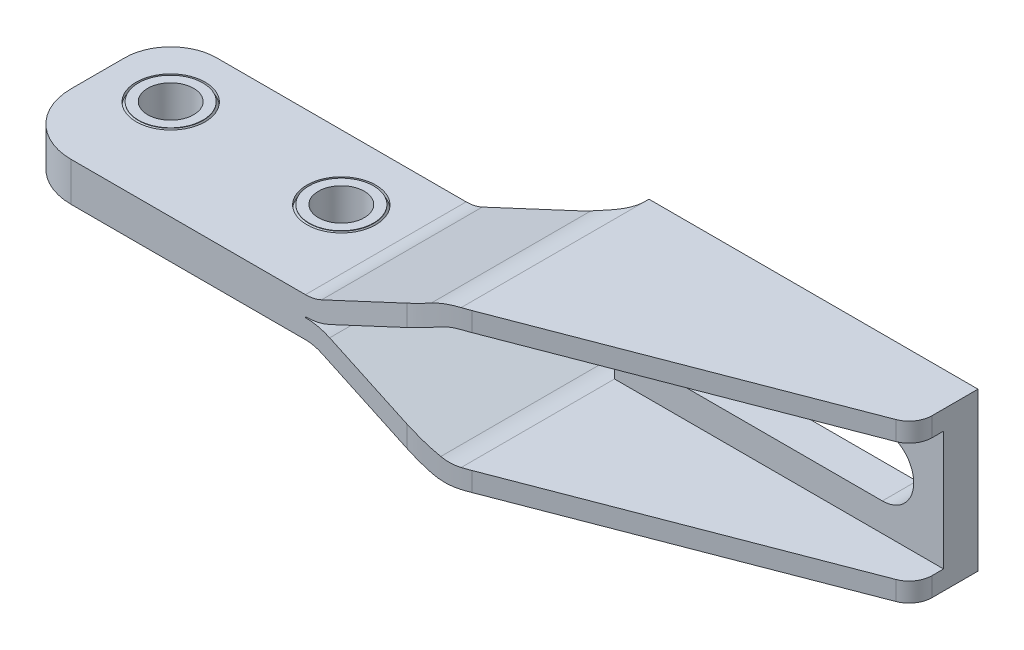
ISO-10303-21;
HEADER;
FILE_DESCRIPTION(('STEP AP214'),'2;1');
FILE_NAME('part.step','',(''),(''),'','','');
FILE_SCHEMA(('AUTOMOTIVE_DESIGN { 1 0 10303 214 1 1 1 1 }'));
ENDSEC;
DATA;
#1=APPLICATION_CONTEXT('core data for automotive mechanical design processes');
#2=APPLICATION_PROTOCOL_DEFINITION('international standard','automotive_design',2000,#1);
#3=PRODUCT_CONTEXT('',#1,'mechanical');
#4=PRODUCT('Part','Part','',(#3));
#5=PRODUCT_RELATED_PRODUCT_CATEGORY('part','',(#4));
#6=PRODUCT_DEFINITION_FORMATION('','',#4);
#7=PRODUCT_DEFINITION_CONTEXT('part definition',#1,'design');
#8=PRODUCT_DEFINITION('design','',#6,#7);
#9=PRODUCT_DEFINITION_SHAPE('','',#8);
#10=(LENGTH_UNIT() NAMED_UNIT(*) SI_UNIT(.MILLI.,.METRE.));
#11=(NAMED_UNIT(*) PLANE_ANGLE_UNIT() SI_UNIT($,.RADIAN.));
#12=(NAMED_UNIT(*) SI_UNIT($,.STERADIAN.) SOLID_ANGLE_UNIT());
#13=UNCERTAINTY_MEASURE_WITH_UNIT(LENGTH_MEASURE(1.E-05),#10,'distance_accuracy_value','');
#14=(GEOMETRIC_REPRESENTATION_CONTEXT(3) GLOBAL_UNCERTAINTY_ASSIGNED_CONTEXT((#13)) GLOBAL_UNIT_ASSIGNED_CONTEXT((#10,
#11,#12)) REPRESENTATION_CONTEXT('',''));
#15=CARTESIAN_POINT('',(0.,0.,0.));
#16=DIRECTION('',(0.,0.,1.));
#17=DIRECTION('',(1.,0.,0.));
#18=AXIS2_PLACEMENT_3D('',#15,#16,#17);
#19=CARTESIAN_POINT('',(22.8,-2.55,0.499999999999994));
#20=DIRECTION('',(0.,1.,0.));
#21=DIRECTION('',(1.,0.,0.));
#22=AXIS2_PLACEMENT_3D('',#19,#20,#21);
#23=CYLINDRICAL_SURFACE('',#22,3.);
#24=CARTESIAN_POINT('',(22.8,2.6,0.499999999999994));
#25=DIRECTION('',(0.,1.,0.));
#26=DIRECTION('',(-1.,0.,0.));
#27=AXIS2_PLACEMENT_3D('',#24,#25,#26);
#28=CIRCLE('',#27,3.);
#29=CARTESIAN_POINT('',(19.8,2.6,0.499999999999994));
#30=VERTEX_POINT('',#29);
#31=EDGE_CURVE('E315',#30,#30,#28,.T.);
#32=ORIENTED_EDGE('',*,*,#31,.T.);
#33=EDGE_LOOP('',(#32));
#34=FACE_BOUND('',#33,.T.);
#35=CARTESIAN_POINT('',(22.8,-2.6,0.499999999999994));
#36=DIRECTION('',(0.,-1.,0.));
#37=DIRECTION('',(1.,0.,0.));
#38=AXIS2_PLACEMENT_3D('',#35,#36,#37);
#39=CIRCLE('',#38,3.);
#40=CARTESIAN_POINT('',(25.8,-2.6,0.499999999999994));
#41=VERTEX_POINT('',#40);
#42=EDGE_CURVE('E298',#41,#41,#39,.T.);
#43=ORIENTED_EDGE('',*,*,#42,.T.);
#44=EDGE_LOOP('',(#43));
#45=FACE_BOUND('',#44,.T.);
#46=ADVANCED_FACE('F14',(#34,#45),#23,.F.);
#47=CARTESIAN_POINT('',(22.8,-2.55,0.499999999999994));
#48=DIRECTION('',(0.,1.,0.));
#49=DIRECTION('',(1.,0.,0.));
#50=AXIS2_PLACEMENT_3D('',#47,#48,#49);
#51=CONICAL_SURFACE('',#50,4.2113248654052,0.523598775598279);
#52=CARTESIAN_POINT('',(22.8,-2.05,0.499999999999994));
#53=DIRECTION('',(0.,1.,0.));
#54=DIRECTION('',(1.,0.,0.));
#55=AXIS2_PLACEMENT_3D('',#52,#53,#54);
#56=CIRCLE('',#55,4.5);
#57=CARTESIAN_POINT('',(27.3,-2.05,0.499999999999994));
#58=VERTEX_POINT('',#57);
#59=EDGE_CURVE('E23',#58,#58,#56,.T.);
#60=ORIENTED_EDGE('',*,*,#59,.F.);
#61=EDGE_LOOP('',(#60));
#62=FACE_BOUND('',#61,.T.);
#63=CARTESIAN_POINT('',(22.8,-2.55,0.499999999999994));
#64=DIRECTION('',(0.,-1.,0.));
#65=DIRECTION('',(1.,0.,0.));
#66=AXIS2_PLACEMENT_3D('',#63,#64,#65);
#67=CIRCLE('',#66,4.2113248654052);
#68=CARTESIAN_POINT('',(27.0113248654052,-2.55,0.499999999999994));
#69=VERTEX_POINT('',#68);
#70=EDGE_CURVE('E303',#69,#69,#67,.T.);
#71=ORIENTED_EDGE('',*,*,#70,.F.);
#72=EDGE_LOOP('',(#71));
#73=FACE_BOUND('',#72,.T.);
#74=ADVANCED_FACE('F885',(#62,#73),#51,.T.);
#75=CARTESIAN_POINT('',(22.8,2.05,0.499999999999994));
#76=DIRECTION('',(0.,-1.,0.));
#77=DIRECTION('',(-1.,0.,0.));
#78=AXIS2_PLACEMENT_3D('',#75,#76,#77);
#79=CONICAL_SURFACE('',#78,4.5,0.52359877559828);
#80=CARTESIAN_POINT('',(22.8,2.55,0.499999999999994));
#81=DIRECTION('',(0.,1.,0.));
#82=DIRECTION('',(1.,0.,0.));
#83=AXIS2_PLACEMENT_3D('',#80,#81,#82);
#84=CIRCLE('',#83,4.2113248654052);
#85=CARTESIAN_POINT('',(27.0113248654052,2.55,0.499999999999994));
#86=VERTEX_POINT('',#85);
#87=EDGE_CURVE('E9',#86,#86,#84,.T.);
#88=ORIENTED_EDGE('',*,*,#87,.F.);
#89=EDGE_LOOP('',(#88));
#90=FACE_BOUND('',#89,.T.);
#91=CARTESIAN_POINT('',(22.8,2.05,0.499999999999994));
#92=DIRECTION('',(0.,1.,0.));
#93=DIRECTION('',(1.,0.,0.));
#94=AXIS2_PLACEMENT_3D('',#91,#92,#93);
#95=CIRCLE('',#94,4.5);
#96=CARTESIAN_POINT('',(27.3,2.05,0.499999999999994));
#97=VERTEX_POINT('',#96);
#98=EDGE_CURVE('E322',#97,#97,#95,.T.);
#99=ORIENTED_EDGE('',*,*,#98,.T.);
#100=EDGE_LOOP('',(#99));
#101=FACE_BOUND('',#100,.T.);
#102=ADVANCED_FACE('F875',(#90,#101),#79,.T.);
#103=CARTESIAN_POINT('',(0.,-2.55,0.));
#104=DIRECTION('',(0.,1.,0.));
#105=DIRECTION('',(1.,0.,0.));
#106=AXIS2_PLACEMENT_3D('',#103,#104,#105);
#107=CYLINDRICAL_SURFACE('',#106,3.);
#108=CARTESIAN_POINT('',(0.,2.6,0.));
#109=DIRECTION('',(0.,1.,0.));
#110=DIRECTION('',(-1.,0.,0.));
#111=AXIS2_PLACEMENT_3D('',#108,#109,#110);
#112=CIRCLE('',#111,3.);
#113=CARTESIAN_POINT('',(-3.,2.6,0.));
#114=VERTEX_POINT('',#113);
#115=EDGE_CURVE('E307',#114,#114,#112,.T.);
#116=ORIENTED_EDGE('',*,*,#115,.T.);
#117=EDGE_LOOP('',(#116));
#118=FACE_BOUND('',#117,.T.);
#119=CARTESIAN_POINT('',(0.,-2.6,0.));
#120=DIRECTION('',(0.,-1.,0.));
#121=DIRECTION('',(1.,0.,0.));
#122=AXIS2_PLACEMENT_3D('',#119,#120,#121);
#123=CIRCLE('',#122,3.);
#124=CARTESIAN_POINT('',(3.,-2.6,0.));
#125=VERTEX_POINT('',#124);
#126=EDGE_CURVE('E289',#125,#125,#123,.T.);
#127=ORIENTED_EDGE('',*,*,#126,.T.);
#128=EDGE_LOOP('',(#127));
#129=FACE_BOUND('',#128,.T.);
#130=ADVANCED_FACE('F861',(#118,#129),#107,.F.);
#131=CARTESIAN_POINT('',(85.,0.,-12.5));
#132=DIRECTION('',(0.,0.,1.));
#133=DIRECTION('',(0.,1.,0.));
#134=AXIS2_PLACEMENT_3D('',#131,#132,#133);
#135=CYLINDRICAL_SURFACE('',#134,4.1);
#136=CARTESIAN_POINT('',(85.,0.,-8.));
#137=DIRECTION('',(0.,0.,1.));
#138=DIRECTION('',(-1.,0.,0.));
#139=AXIS2_PLACEMENT_3D('',#136,#137,#138);
#140=CIRCLE('',#139,4.1);
#141=CARTESIAN_POINT('',(85.,-4.1,-8.));
#142=VERTEX_POINT('',#141);
#143=CARTESIAN_POINT('',(85.,4.1,-8.));
#144=VERTEX_POINT('',#143);
#145=EDGE_CURVE('E348',#142,#144,#140,.T.);
#146=ORIENTED_EDGE('',*,*,#145,.T.);
#147=DIRECTION('',(0.,0.,1.));
#148=VECTOR('',#147,1.);
#149=CARTESIAN_POINT('',(85.,4.1,-12.5));
#150=LINE('',#149,#148);
#151=CARTESIAN_POINT('',(85.,4.1,-12.5));
#152=VERTEX_POINT('',#151);
#153=EDGE_CURVE('E375',#152,#144,#150,.T.);
#154=ORIENTED_EDGE('',*,*,#153,.F.);
#155=CARTESIAN_POINT('',(85.,0.,-12.5));
#156=DIRECTION('',(0.,0.,1.));
#157=DIRECTION('',(-1.,0.,0.));
#158=AXIS2_PLACEMENT_3D('',#155,#156,#157);
#159=CIRCLE('',#158,4.1);
#160=CARTESIAN_POINT('',(85.,-4.1,-12.5));
#161=VERTEX_POINT('',#160);
#162=EDGE_CURVE('E361',#161,#152,#159,.T.);
#163=ORIENTED_EDGE('',*,*,#162,.F.);
#164=DIRECTION('',(0.,0.,1.));
#165=VECTOR('',#164,1.);
#166=CARTESIAN_POINT('',(85.,-4.1,-12.5));
#167=LINE('',#166,#165);
#168=EDGE_CURVE('E377',#161,#142,#167,.T.);
#169=ORIENTED_EDGE('',*,*,#168,.T.);
#170=EDGE_LOOP('',(#146,#154,#163,#169));
#171=FACE_BOUND('',#170,.T.);
#172=ADVANCED_FACE('F874',(#171),#135,.F.);
#173=CARTESIAN_POINT('',(85.,4.1,-12.5));
#174=DIRECTION('',(0.,1.,0.));
#175=DIRECTION('',(-1.,0.,0.));
#176=AXIS2_PLACEMENT_3D('',#173,#174,#175);
#177=PLANE('',#176);
#178=DIRECTION('',(-1.,0.,0.));
#179=VECTOR('',#178,1.);
#180=CARTESIAN_POINT('',(85.,4.1,-8.));
#181=LINE('',#180,#179);
#182=CARTESIAN_POINT('',(58.,4.1,-8.));
#183=VERTEX_POINT('',#182);
#184=EDGE_CURVE('E39',#144,#183,#181,.T.);
#185=ORIENTED_EDGE('',*,*,#184,.T.);
#186=DIRECTION('',(0.,0.,1.));
#187=VECTOR('',#186,1.);
#188=CARTESIAN_POINT('',(58.,4.1,-12.5));
#189=LINE('',#188,#187);
#190=CARTESIAN_POINT('',(58.,4.1,-12.5));
#191=VERTEX_POINT('',#190);
#192=EDGE_CURVE('E373',#191,#183,#189,.T.);
#193=ORIENTED_EDGE('',*,*,#192,.F.);
#194=DIRECTION('',(-1.,0.,0.));
#195=VECTOR('',#194,1.);
#196=CARTESIAN_POINT('',(85.,4.1,-12.5));
#197=LINE('',#196,#195);
#198=EDGE_CURVE('E364',#152,#191,#197,.T.);
#199=ORIENTED_EDGE('',*,*,#198,.F.);
#200=ORIENTED_EDGE('',*,*,#153,.T.);
#201=EDGE_LOOP('',(#185,#193,#199,#200));
#202=FACE_BOUND('',#201,.T.);
#203=ADVANCED_FACE('F883',(#202),#177,.F.);
#204=CARTESIAN_POINT('',(58.,0.,-12.5));
#205=DIRECTION('',(0.,0.,1.));
#206=DIRECTION('',(0.,1.,0.));
#207=AXIS2_PLACEMENT_3D('',#204,#205,#206);
#208=CYLINDRICAL_SURFACE('',#207,4.1);
#209=CARTESIAN_POINT('',(58.,0.,-8.));
#210=DIRECTION('',(0.,0.,1.));
#211=DIRECTION('',(1.,0.,0.));
#212=AXIS2_PLACEMENT_3D('',#209,#210,#211);
#213=CIRCLE('',#212,4.1);
#214=CARTESIAN_POINT('',(58.,-4.1,-8.));
#215=VERTEX_POINT('',#214);
#216=EDGE_CURVE('E354',#183,#215,#213,.T.);
#217=ORIENTED_EDGE('',*,*,#216,.T.);
#218=DIRECTION('',(0.,0.,1.));
#219=VECTOR('',#218,1.);
#220=CARTESIAN_POINT('',(58.,-4.1,-12.5));
#221=LINE('',#220,#219);
#222=CARTESIAN_POINT('',(58.,-4.1,-12.5));
#223=VERTEX_POINT('',#222);
#224=EDGE_CURVE('E370',#223,#215,#221,.T.);
#225=ORIENTED_EDGE('',*,*,#224,.F.);
#226=CARTESIAN_POINT('',(58.,0.,-12.5));
#227=DIRECTION('',(0.,0.,1.));
#228=DIRECTION('',(1.,0.,0.));
#229=AXIS2_PLACEMENT_3D('',#226,#227,#228);
#230=CIRCLE('',#229,4.1);
#231=EDGE_CURVE('E367',#191,#223,#230,.T.);
#232=ORIENTED_EDGE('',*,*,#231,.F.);
#233=ORIENTED_EDGE('',*,*,#192,.T.);
#234=EDGE_LOOP('',(#217,#225,#232,#233));
#235=FACE_BOUND('',#234,.T.);
#236=ADVANCED_FACE('F877',(#235),#208,.F.);
#237=CARTESIAN_POINT('',(58.,-4.1,-12.5));
#238=DIRECTION('',(0.,-1.,0.));
#239=DIRECTION('',(1.,0.,0.));
#240=AXIS2_PLACEMENT_3D('',#237,#238,#239);
#241=PLANE('',#240);
#242=DIRECTION('',(1.,0.,0.));
#243=VECTOR('',#242,1.);
#244=CARTESIAN_POINT('',(58.,-4.1,-8.));
#245=LINE('',#244,#243);
#246=EDGE_CURVE('E347',#215,#142,#245,.T.);
#247=ORIENTED_EDGE('',*,*,#246,.T.);
#248=ORIENTED_EDGE('',*,*,#168,.F.);
#249=DIRECTION('',(1.,0.,0.));
#250=VECTOR('',#249,1.);
#251=CARTESIAN_POINT('',(58.,-4.1,-12.5));
#252=LINE('',#251,#250);
#253=EDGE_CURVE('E31',#223,#161,#252,.T.);
#254=ORIENTED_EDGE('',*,*,#253,.F.);
#255=ORIENTED_EDGE('',*,*,#224,.T.);
#256=EDGE_LOOP('',(#247,#248,#254,#255));
#257=FACE_BOUND('',#256,.T.);
#258=ADVANCED_FACE('F413',(#257),#241,.F.);
#259=CARTESIAN_POINT('',(90.,-10.3,-6.50000000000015));
#260=DIRECTION('',(0.,1.,0.));
#261=DIRECTION('',(-1.,0.,0.));
#262=AXIS2_PLACEMENT_3D('',#259,#260,#261);
#263=CYLINDRICAL_SURFACE('',#262,3.00000000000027);
#264=DIRECTION('',(0.,1.,0.));
#265=VECTOR('',#264,1.);
#266=CARTESIAN_POINT('',(91.075103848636,-10.3,-3.6992587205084));
#267=LINE('',#266,#265);
#268=CARTESIAN_POINT('',(91.075103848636,7.8,-3.6992587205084));
#269=VERTEX_POINT('',#268);
#270=CARTESIAN_POINT('',(91.075103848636,10.3,-3.6992587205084));
#271=VERTEX_POINT('',#270);
#272=EDGE_CURVE('E603',#269,#271,#267,.T.);
#273=ORIENTED_EDGE('',*,*,#272,.F.);
#274=CARTESIAN_POINT('',(90.,7.8,-6.50000000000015));
#275=DIRECTION('',(0.,-1.,0.));
#276=DIRECTION('',(1.,0.,0.));
#277=AXIS2_PLACEMENT_3D('',#274,#275,#276);
#278=CIRCLE('',#277,3.00000000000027);
#279=CARTESIAN_POINT('',(93.,7.8,-6.5));
#280=VERTEX_POINT('',#279);
#281=EDGE_CURVE('E653',#269,#280,#278,.F.);
#282=ORIENTED_EDGE('',*,*,#281,.T.);
#283=DIRECTION('',(0.,1.,0.));
#284=VECTOR('',#283,1.);
#285=CARTESIAN_POINT('',(93.,-10.3,-6.5));
#286=LINE('',#285,#284);
#287=CARTESIAN_POINT('',(93.,10.3,-6.5));
#288=VERTEX_POINT('',#287);
#289=EDGE_CURVE('E597',#280,#288,#286,.T.);
#290=ORIENTED_EDGE('',*,*,#289,.T.);
#291=CARTESIAN_POINT('',(90.,10.3,-6.50000000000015));
#292=DIRECTION('',(0.,1.,0.));
#293=DIRECTION('',(-1.,0.,0.));
#294=AXIS2_PLACEMENT_3D('',#291,#292,#293);
#295=CIRCLE('',#294,3.00000000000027);
#296=EDGE_CURVE('E577',#271,#288,#295,.T.);
#297=ORIENTED_EDGE('',*,*,#296,.F.);
#298=EDGE_LOOP('',(#273,#282,#290,#297));
#299=FACE_BOUND('',#298,.T.);
#300=ADVANCED_FACE('F844',(#299),#263,.T.);
#301=CARTESIAN_POINT('',(93.,-10.3,-12.5));
#302=DIRECTION('',(0.,0.,-1.));
#303=DIRECTION('',(0.,-1.,0.));
#304=AXIS2_PLACEMENT_3D('',#301,#302,#303);
#305=PLANE('',#304);
#306=ORIENTED_EDGE('',*,*,#253,.T.);
#307=ORIENTED_EDGE('',*,*,#162,.T.);
#308=ORIENTED_EDGE('',*,*,#198,.T.);
#309=ORIENTED_EDGE('',*,*,#231,.T.);
#310=EDGE_LOOP('',(#306,#307,#308,#309));
#311=FACE_BOUND('',#310,.T.);
#312=DIRECTION('',(0.,1.,0.));
#313=VECTOR('',#312,1.);
#314=CARTESIAN_POINT('',(50.,-10.3,-12.5));
#315=LINE('',#314,#313);
#316=CARTESIAN_POINT('',(50.,-10.3,-12.5));
#317=VERTEX_POINT('',#316);
#318=CARTESIAN_POINT('',(50.,10.3,-12.5));
#319=VERTEX_POINT('',#318);
#320=EDGE_CURVE('E631',#317,#319,#315,.T.);
#321=ORIENTED_EDGE('',*,*,#320,.T.);
#322=DIRECTION('',(-1.,0.,0.));
#323=VECTOR('',#322,1.);
#324=CARTESIAN_POINT('',(93.,10.3,-12.5));
#325=LINE('',#324,#323);
#326=CARTESIAN_POINT('',(93.,10.3,-12.5));
#327=VERTEX_POINT('',#326);
#328=EDGE_CURVE('E565',#327,#319,#325,.T.);
#329=ORIENTED_EDGE('',*,*,#328,.F.);
#330=DIRECTION('',(0.,1.,0.));
#331=VECTOR('',#330,1.);
#332=CARTESIAN_POINT('',(93.,-10.3,-12.5));
#333=LINE('',#332,#331);
#334=CARTESIAN_POINT('',(93.,-10.3,-12.5));
#335=VERTEX_POINT('',#334);
#336=EDGE_CURVE('E633',#335,#327,#333,.T.);
#337=ORIENTED_EDGE('',*,*,#336,.F.);
#338=DIRECTION('',(-1.,0.,0.));
#339=VECTOR('',#338,1.);
#340=CARTESIAN_POINT('',(93.,-10.3,-12.5));
#341=LINE('',#340,#339);
#342=EDGE_CURVE('E583',#335,#317,#341,.T.);
#343=ORIENTED_EDGE('',*,*,#342,.T.);
#344=EDGE_LOOP('',(#321,#329,#337,#343));
#345=FACE_BOUND('',#344,.T.);
#346=ADVANCED_FACE('F420',(#311,#345),#305,.T.);
#347=CARTESIAN_POINT('',(50.,2.80000000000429,-8.));
#348=DIRECTION('',(0.,0.,1.));
#349=DIRECTION('',(0.,1.,0.));
#350=AXIS2_PLACEMENT_3D('',#347,#348,#349);
#351=PLANE('',#350);
#352=ORIENTED_EDGE('',*,*,#246,.F.);
#353=ORIENTED_EDGE('',*,*,#216,.F.);
#354=ORIENTED_EDGE('',*,*,#184,.F.);
#355=ORIENTED_EDGE('',*,*,#145,.F.);
#356=EDGE_LOOP('',(#352,#353,#354,#355));
#357=FACE_BOUND('',#356,.T.);
#358=DIRECTION('',(0.,1.,0.));
#359=VECTOR('',#358,1.);
#360=CARTESIAN_POINT('',(50.,-7.8,-8.));
#361=LINE('',#360,#359);
#362=CARTESIAN_POINT('',(50.,-7.8,-8.));
#363=VERTEX_POINT('',#362);
#364=CARTESIAN_POINT('',(50.,7.8,-8.));
#365=VERTEX_POINT('',#364);
#366=EDGE_CURVE('E379',#363,#365,#361,.T.);
#367=ORIENTED_EDGE('',*,*,#366,.F.);
#368=DIRECTION('',(1.,0.,0.));
#369=VECTOR('',#368,1.);
#370=CARTESIAN_POINT('',(50.,-7.8,-8.));
#371=LINE('',#370,#369);
#372=CARTESIAN_POINT('',(93.,-7.8,-8.));
#373=VERTEX_POINT('',#372);
#374=EDGE_CURVE('E672',#363,#373,#371,.T.);
#375=ORIENTED_EDGE('',*,*,#374,.T.);
#376=DIRECTION('',(0.,-1.,0.));
#377=VECTOR('',#376,1.);
#378=CARTESIAN_POINT('',(93.,-10.3,-8.));
#379=LINE('',#378,#377);
#380=CARTESIAN_POINT('',(93.,7.8,-8.));
#381=VERTEX_POINT('',#380);
#382=EDGE_CURVE('E443',#381,#373,#379,.T.);
#383=ORIENTED_EDGE('',*,*,#382,.F.);
#384=DIRECTION('',(-1.,0.,0.));
#385=VECTOR('',#384,1.);
#386=CARTESIAN_POINT('',(98.,7.8,-8.));
#387=LINE('',#386,#385);
#388=EDGE_CURVE('E670',#381,#365,#387,.T.);
#389=ORIENTED_EDGE('',*,*,#388,.T.);
#390=EDGE_LOOP('',(#367,#375,#383,#389));
#391=FACE_BOUND('',#390,.T.);
#392=ADVANCED_FACE('F417',(#357,#391),#351,.T.);
#393=CARTESIAN_POINT('',(93.,-10.3,-6.5));
#394=DIRECTION('',(1.,0.,0.));
#395=DIRECTION('',(0.,1.,0.));
#396=AXIS2_PLACEMENT_3D('',#393,#394,#395);
#397=PLANE('',#396);
#398=ORIENTED_EDGE('',*,*,#382,.T.);
#399=DIRECTION('',(0.,0.,1.));
#400=VECTOR('',#399,1.);
#401=CARTESIAN_POINT('',(93.,-7.8,-6.5));
#402=LINE('',#401,#400);
#403=CARTESIAN_POINT('',(93.,-7.8,-6.5));
#404=VERTEX_POINT('',#403);
#405=EDGE_CURVE('E662',#373,#404,#402,.T.);
#406=ORIENTED_EDGE('',*,*,#405,.T.);
#407=CARTESIAN_POINT('',(93.,-10.3,-6.5));
#408=VERTEX_POINT('',#407);
#409=EDGE_CURVE('E600',#408,#404,#286,.T.);
#410=ORIENTED_EDGE('',*,*,#409,.F.);
#411=DIRECTION('',(0.,0.,-1.));
#412=VECTOR('',#411,1.);
#413=CARTESIAN_POINT('',(93.,-10.3,-6.5));
#414=LINE('',#413,#412);
#415=EDGE_CURVE('E580',#408,#335,#414,.T.);
#416=ORIENTED_EDGE('',*,*,#415,.T.);
#417=ORIENTED_EDGE('',*,*,#336,.T.);
#418=DIRECTION('',(0.,0.,-1.));
#419=VECTOR('',#418,1.);
#420=CARTESIAN_POINT('',(93.,10.3,-6.5));
#421=LINE('',#420,#419);
#422=EDGE_CURVE('E564',#288,#327,#421,.T.);
#423=ORIENTED_EDGE('',*,*,#422,.F.);
#424=ORIENTED_EDGE('',*,*,#289,.F.);
#425=DIRECTION('',(0.,0.,-1.));
#426=VECTOR('',#425,1.);
#427=CARTESIAN_POINT('',(93.,7.8,-6.5));
#428=LINE('',#427,#426);
#429=EDGE_CURVE('E664',#280,#381,#428,.T.);
#430=ORIENTED_EDGE('',*,*,#429,.T.);
#431=EDGE_LOOP('',(#398,#406,#410,#416,#417,#423,#424,#430));
#432=FACE_BOUND('',#431,.T.);
#433=ADVANCED_FACE('F16',(#432),#397,.T.);
#434=ORIENTED_EDGE('',*,*,#409,.T.);
#435=CARTESIAN_POINT('',(90.,-7.8,-6.50000000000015));
#436=DIRECTION('',(0.,1.,0.));
#437=DIRECTION('',(-1.,0.,0.));
#438=AXIS2_PLACEMENT_3D('',#435,#436,#437);
#439=CIRCLE('',#438,3.00000000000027);
#440=CARTESIAN_POINT('',(91.075103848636,-7.8,-3.6992587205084));
#441=VERTEX_POINT('',#440);
#442=EDGE_CURVE('E655',#404,#441,#439,.F.);
#443=ORIENTED_EDGE('',*,*,#442,.T.);
#444=CARTESIAN_POINT('',(91.075103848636,-10.3,-3.6992587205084));
#445=VERTEX_POINT('',#444);
#446=EDGE_CURVE('E604',#445,#441,#267,.T.);
#447=ORIENTED_EDGE('',*,*,#446,.F.);
#448=CARTESIAN_POINT('',(90.,-10.3,-6.50000000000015));
#449=DIRECTION('',(0.,1.,0.));
#450=DIRECTION('',(-1.,0.,0.));
#451=AXIS2_PLACEMENT_3D('',#448,#449,#450);
#452=CIRCLE('',#451,3.00000000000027);
#453=EDGE_CURVE('E594',#445,#408,#452,.T.);
#454=ORIENTED_EDGE('',*,*,#453,.T.);
#455=EDGE_LOOP('',(#434,#443,#447,#454));
#456=FACE_BOUND('',#455,.T.);
#457=ADVANCED_FACE('F807',(#456),#263,.T.);
#458=CARTESIAN_POINT('',(0.,2.05,0.));
#459=DIRECTION('',(0.,-1.,0.));
#460=DIRECTION('',(-1.,0.,0.));
#461=AXIS2_PLACEMENT_3D('',#458,#459,#460);
#462=CONICAL_SURFACE('',#461,4.5,0.52359877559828);
#463=CARTESIAN_POINT('',(0.,2.55,0.));
#464=DIRECTION('',(0.,1.,0.));
#465=DIRECTION('',(1.,0.,0.));
#466=AXIS2_PLACEMENT_3D('',#463,#464,#465);
#467=CIRCLE('',#466,4.2113248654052);
#468=CARTESIAN_POINT('',(4.2113248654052,2.55,0.));
#469=VERTEX_POINT('',#468);
#470=EDGE_CURVE('E325',#469,#469,#467,.T.);
#471=ORIENTED_EDGE('',*,*,#470,.F.);
#472=EDGE_LOOP('',(#471));
#473=FACE_BOUND('',#472,.T.);
#474=CARTESIAN_POINT('',(0.,2.05,0.));
#475=DIRECTION('',(0.,1.,0.));
#476=DIRECTION('',(1.,0.,0.));
#477=AXIS2_PLACEMENT_3D('',#474,#475,#476);
#478=CIRCLE('',#477,4.5);
#479=CARTESIAN_POINT('',(4.5,2.05,0.));
#480=VERTEX_POINT('',#479);
#481=EDGE_CURVE('E328',#480,#480,#478,.T.);
#482=ORIENTED_EDGE('',*,*,#481,.T.);
#483=EDGE_LOOP('',(#482));
#484=FACE_BOUND('',#483,.T.);
#485=ADVANCED_FACE('F858',(#473,#484),#462,.T.);
#486=CARTESIAN_POINT('',(46.,10.3,-12.0000000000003));
#487=DIRECTION('',(0.,-1.,0.));
#488=DIRECTION('',(1.,0.,0.));
#489=AXIS2_PLACEMENT_3D('',#486,#487,#488);
#490=PLANE('',#489);
#491=DIRECTION('',(0.,0.,-1.));
#492=VECTOR('',#491,1.);
#493=CARTESIAN_POINT('',(50.,10.3,15.));
#494=LINE('',#493,#492);
#495=CARTESIAN_POINT('',(49.9999999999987,10.3,12.0358883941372));
#496=VERTEX_POINT('',#495);
#497=CARTESIAN_POINT('',(50.,10.3,-12.));
#498=VERTEX_POINT('',#497);
#499=EDGE_CURVE('E722',#496,#498,#494,.T.);
#500=ORIENTED_EDGE('',*,*,#499,.F.);
#501=CARTESIAN_POINT('',(43.8652666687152,10.3,-7.00000000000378));
#502=DIRECTION('',(0.,1.,0.));
#503=DIRECTION('',(-1.,0.,0.));
#504=AXIS2_PLACEMENT_3D('',#501,#502,#503);
#505=CIRCLE('',#504,20.0000000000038);
#506=CARTESIAN_POINT('',(51.032625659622,10.3,11.671608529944));
#507=VERTEX_POINT('',#506);
#508=EDGE_CURVE('E571',#496,#507,#505,.T.);
#509=ORIENTED_EDGE('',*,*,#508,.T.);
#510=DIRECTION('',(0.933580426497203,0.,-0.358367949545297));
#511=VECTOR('',#510,1.);
#512=CARTESIAN_POINT('',(51.032625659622,10.3,11.671608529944));
#513=LINE('',#512,#511);
#514=EDGE_CURVE('E574',#507,#271,#513,.T.);
#515=ORIENTED_EDGE('',*,*,#514,.T.);
#516=ORIENTED_EDGE('',*,*,#296,.T.);
#517=ORIENTED_EDGE('',*,*,#422,.T.);
#518=ORIENTED_EDGE('',*,*,#328,.T.);
#519=DIRECTION('',(0.,0.,1.));
#520=VECTOR('',#519,1.);
#521=CARTESIAN_POINT('',(50.,10.3,-12.5));
#522=LINE('',#521,#520);
#523=EDGE_CURVE('E568',#319,#498,#522,.T.);
#524=ORIENTED_EDGE('',*,*,#523,.T.);
#525=EDGE_LOOP('',(#500,#509,#515,#516,#517,#518,#524));
#526=FACE_BOUND('',#525,.T.);
#527=ADVANCED_FACE('F530',(#526),#490,.F.);
#528=CARTESIAN_POINT('',(51.032625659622,-10.3,11.671608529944));
#529=DIRECTION('',(0.358367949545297,0.,0.933580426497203));
#530=DIRECTION('',(0.933580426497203,0.,-0.358367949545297));
#531=AXIS2_PLACEMENT_3D('',#528,#529,#530);
#532=PLANE('',#531);
#533=DIRECTION('',(0.,1.,0.));
#534=VECTOR('',#533,1.);
#535=CARTESIAN_POINT('',(51.032625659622,-10.3,11.671608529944));
#536=LINE('',#535,#534);
#537=CARTESIAN_POINT('',(51.032625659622,7.8,11.671608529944));
#538=VERTEX_POINT('',#537);
#539=EDGE_CURVE('E607',#538,#507,#536,.T.);
#540=ORIENTED_EDGE('',*,*,#539,.F.);
#541=DIRECTION('',(0.933580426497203,0.,-0.358367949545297));
#542=VECTOR('',#541,1.);
#543=CARTESIAN_POINT('',(51.032625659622,7.8,11.671608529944));
#544=LINE('',#543,#542);
#545=EDGE_CURVE('E702',#538,#269,#544,.T.);
#546=ORIENTED_EDGE('',*,*,#545,.T.);
#547=ORIENTED_EDGE('',*,*,#272,.T.);
#548=ORIENTED_EDGE('',*,*,#514,.F.);
#549=EDGE_LOOP('',(#540,#546,#547,#548));
#550=FACE_BOUND('',#549,.T.);
#551=ADVANCED_FACE('F800',(#550),#532,.T.);
#552=CARTESIAN_POINT('',(98.,7.8,23.));
#553=DIRECTION('',(0.,-1.,0.));
#554=DIRECTION('',(1.,0.,0.));
#555=AXIS2_PLACEMENT_3D('',#552,#553,#554);
#556=PLANE('',#555);
#557=DIRECTION('',(0.,0.,-1.));
#558=VECTOR('',#557,1.);
#559=CARTESIAN_POINT('',(50.,7.8,23.));
#560=LINE('',#559,#558);
#561=CARTESIAN_POINT('',(50.,7.8,12.0358883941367));
#562=VERTEX_POINT('',#561);
#563=EDGE_CURVE('E676',#562,#365,#560,.T.);
#564=ORIENTED_EDGE('',*,*,#563,.T.);
#565=ORIENTED_EDGE('',*,*,#388,.F.);
#566=ORIENTED_EDGE('',*,*,#429,.F.);
#567=ORIENTED_EDGE('',*,*,#281,.F.);
#568=ORIENTED_EDGE('',*,*,#545,.F.);
#569=CARTESIAN_POINT('',(43.8652666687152,7.8,-7.00000000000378));
#570=DIRECTION('',(0.,-1.,0.));
#571=DIRECTION('',(1.,0.,0.));
#572=AXIS2_PLACEMENT_3D('',#569,#570,#571);
#573=CIRCLE('',#572,20.0000000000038);
#574=EDGE_CURVE('E706',#562,#538,#573,.F.);
#575=ORIENTED_EDGE('',*,*,#574,.F.);
#576=EDGE_LOOP('',(#564,#565,#566,#567,#568,#575));
#577=FACE_BOUND('',#576,.T.);
#578=ADVANCED_FACE('F495',(#577),#556,.T.);
#579=CARTESIAN_POINT('',(49.9999999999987,2.80000000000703,15.));
#580=DIRECTION('',(0.,0.,-1.));
#581=DIRECTION('',(0.,-1.,0.));
#582=AXIS2_PLACEMENT_3D('',#579,#580,#581);
#583=CYLINDRICAL_SURFACE('',#582,7.49999999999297);
#584=DIRECTION('',(0.,0.,-1.));
#585=VECTOR('',#584,1.);
#586=CARTESIAN_POINT('',(46.830157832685,9.5972127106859,15.));
#587=LINE('',#586,#585);
#588=CARTESIAN_POINT('',(46.830157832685,9.5972127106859,12.7790146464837));
#589=VERTEX_POINT('',#588);
#590=CARTESIAN_POINT('',(46.830157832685,9.5972127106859,-8.08709341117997));
#591=VERTEX_POINT('',#590);
#592=EDGE_CURVE('E725',#589,#591,#587,.T.);
#593=ORIENTED_EDGE('',*,*,#592,.F.);
#594=CARTESIAN_POINT('',(50.,10.3,12.0358883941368));
#595=CARTESIAN_POINT('',(49.802769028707,10.3000279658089,12.0994817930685));
#596=CARTESIAN_POINT('',(49.6045004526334,10.292220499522,12.1599640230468));
#597=CARTESIAN_POINT('',(49.2072223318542,10.2606386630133,12.2744897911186));
#598=CARTESIAN_POINT('',(49.0082123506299,10.236852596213,12.3285285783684));
#599=CARTESIAN_POINT('',(48.6149092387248,10.1736323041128,12.4288798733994));
#600=CARTESIAN_POINT('',(48.4205991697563,10.1345087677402,12.4753213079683));
#601=CARTESIAN_POINT('',(48.0344438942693,10.0405823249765,12.5616218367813));
#602=CARTESIAN_POINT('',(47.8425971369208,9.98578984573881,12.6014852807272));
#603=CARTESIAN_POINT('',(47.5136116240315,9.87738151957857,12.664934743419));
#604=CARTESIAN_POINT('',(47.3755624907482,9.82736942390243,12.6900228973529));
#605=CARTESIAN_POINT('',(47.1011643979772,9.71872162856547,12.7369840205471));
#606=CARTESIAN_POINT('',(46.9648347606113,9.66002659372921,12.7588326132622));
#607=CARTESIAN_POINT('',(46.830157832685,9.5972127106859,12.7790146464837));
#608=B_SPLINE_CURVE_WITH_KNOTS('',3,(#594,#595,#596,#597,#598,#599,#600,#601,#602,#603,#604,
#605,#606,#607),.UNSPECIFIED.,.F.,.F.,(4,2,2,2,2,2,4),(0.,0.621567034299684,1.2435895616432,
1.85361383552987,2.46323309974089,2.90982783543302,3.35962889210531),.UNSPECIFIED.);
#609=EDGE_CURVE('E473',#496,#589,#608,.T.);
#610=ORIENTED_EDGE('',*,*,#609,.F.);
#611=ORIENTED_EDGE('',*,*,#499,.T.);
#612=CARTESIAN_POINT('',(46.830157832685,9.5972127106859,-8.08709341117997));
#613=CARTESIAN_POINT('',(46.9239873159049,9.64099039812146,-8.10698168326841));
#614=CARTESIAN_POINT('',(47.0181223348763,9.68250383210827,-8.13049811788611));
#615=CARTESIAN_POINT('',(47.2061788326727,9.7609532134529,-8.18494045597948));
#616=CARTESIAN_POINT('',(47.300100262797,9.79788820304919,-8.21586790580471));
#617=CARTESIAN_POINT('',(47.4867139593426,9.86705737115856,-8.28522107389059));
#618=CARTESIAN_POINT('',(47.5794079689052,9.89929906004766,-8.32363457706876));
#619=CARTESIAN_POINT('',(47.7628210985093,9.95921313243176,-8.40797462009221));
#620=CARTESIAN_POINT('',(47.8535404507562,9.98688605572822,-8.453900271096));
#621=CARTESIAN_POINT('',(48.0322949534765,10.0378721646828,-8.55322598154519));
#622=CARTESIAN_POINT('',(48.1203249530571,10.0611773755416,-8.60663940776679));
#623=CARTESIAN_POINT('',(48.292708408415,10.1036319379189,-8.7206447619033));
#624=CARTESIAN_POINT('',(48.3770604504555,10.1227797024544,-8.78123941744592));
#625=CARTESIAN_POINT('',(48.5411948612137,10.1572356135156,-8.90918336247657));
#626=CARTESIAN_POINT('',(48.6209808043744,10.1725467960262,-8.97652725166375));
#627=CARTESIAN_POINT('',(48.7753718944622,10.1997590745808,-9.11759622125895));
#628=CARTESIAN_POINT('',(48.8499750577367,10.2116588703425,-9.19132372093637));
#629=CARTESIAN_POINT('',(48.9926674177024,10.2323907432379,-9.34392285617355));
#630=CARTESIAN_POINT('',(49.0608113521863,10.2412506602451,-9.42273949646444));
#631=CARTESIAN_POINT('',(49.1908562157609,10.2565120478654,-9.58560219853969));
#632=CARTESIAN_POINT('',(49.2527548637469,10.2629126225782,-9.66965015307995));
#633=CARTESIAN_POINT('',(49.4284163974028,10.2791148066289,-9.92890113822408));
#634=CARTESIAN_POINT('',(49.5321695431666,10.285920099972,-10.1112376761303));
#635=CARTESIAN_POINT('',(49.7140320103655,10.2951282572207,-10.4986787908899));
#636=CARTESIAN_POINT('',(49.790722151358,10.2973113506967,-10.7044482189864));
#637=CARTESIAN_POINT('',(49.9093668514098,10.299690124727,-11.1256140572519));
#638=CARTESIAN_POINT('',(49.9513714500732,10.299888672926,-11.3409961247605));
#639=CARTESIAN_POINT('',(49.9836805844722,10.2999841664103,-11.6315192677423));
#640=CARTESIAN_POINT('',(49.9898032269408,10.2999937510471,-11.7051444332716));
#641=CARTESIAN_POINT('',(49.9979576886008,10.3000012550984,-11.8525031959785));
#642=CARTESIAN_POINT('',(49.9999960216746,10.2999991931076,-11.9262364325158));
#643=CARTESIAN_POINT('',(50.,10.3,-12.0000000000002));
#644=B_SPLINE_CURVE_WITH_KNOTS('',3,(#612,#613,#614,#615,#616,#617,#618,#619,#620,#621,#622,
#623,#624,#625,#626,#627,#628,#629,#630,#631,#632,#633,#634,#635,#636,#637,#638,#639,#640,#641,
#642,#643),.UNSPECIFIED.,.F.,.F.,(4,2,2,2,2,2,2,2,2,2,2,2,2,2,2,4),(0.,0.316235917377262,
0.632537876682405,0.948327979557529,1.26408074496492,1.58040452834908,1.89684884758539,
2.21304195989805,2.5293554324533,2.84268946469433,3.15613753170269,3.78292613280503,
4.43890306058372,5.09393197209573,5.3154875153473,5.53668942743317),.UNSPECIFIED.);
#645=EDGE_CURVE('E482',#591,#498,#644,.T.);
#646=ORIENTED_EDGE('',*,*,#645,.F.);
#647=EDGE_LOOP('',(#593,#610,#611,#646));
#648=FACE_BOUND('',#647,.T.);
#649=ADVANCED_FACE('F423',(#648),#583,.T.);
#650=CARTESIAN_POINT('',(50.,2.80000000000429,23.));
#651=DIRECTION('',(0.,0.,-1.));
#652=DIRECTION('',(0.,-1.,0.));
#653=AXIS2_PLACEMENT_3D('',#650,#651,#652);
#654=CYLINDRICAL_SURFACE('',#653,4.99999999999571);
#655=DIRECTION('',(0.,0.,-1.));
#656=VECTOR('',#655,1.);
#657=CARTESIAN_POINT('',(47.886771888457,7.3314751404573,23.));
#658=LINE('',#657,#656);
#659=CARTESIAN_POINT('',(47.886771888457,7.3314751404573,12.5915159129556));
#660=VERTEX_POINT('',#659);
#661=CARTESIAN_POINT('',(47.886771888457,7.3314751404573,-8.47294856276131));
#662=VERTEX_POINT('',#661);
#663=EDGE_CURVE('E699',#660,#662,#658,.T.);
#664=ORIENTED_EDGE('',*,*,#663,.T.);
#665=CARTESIAN_POINT('',(47.886771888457,7.3314751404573,-8.4729485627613));
#666=CARTESIAN_POINT('',(47.9682037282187,7.36947129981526,-8.51647826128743));
#667=CARTESIAN_POINT('',(48.049157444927,7.40453071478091,-8.56344059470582));
#668=CARTESIAN_POINT('',(48.2090860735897,7.46904780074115,-8.66401466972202));
#669=CARTESIAN_POINT('',(48.2880619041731,7.49850811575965,-8.71762325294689));
#670=CARTESIAN_POINT('',(48.4426827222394,7.55199289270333,-8.83101600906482));
#671=CARTESIAN_POINT('',(48.5183430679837,7.57604517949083,-8.89076615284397));
#672=CARTESIAN_POINT('',(48.6659126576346,7.61934872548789,-9.01632874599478));
#673=CARTESIAN_POINT('',(48.7378216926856,7.63859971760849,-9.08214153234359));
#674=CARTESIAN_POINT('',(48.8770443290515,7.67279235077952,-9.21932535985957));
#675=CARTESIAN_POINT('',(48.9443635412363,7.68773932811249,-9.29068937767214));
#676=CARTESIAN_POINT('',(49.0738847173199,7.71392685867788,-9.43857178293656));
#677=CARTESIAN_POINT('',(49.1360846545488,7.72516594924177,-9.51509219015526));
#678=CARTESIAN_POINT('',(49.3142544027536,7.75421637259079,-9.75174937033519));
#679=CARTESIAN_POINT('',(49.4217747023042,7.76735647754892,-9.91896298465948));
#680=CARTESIAN_POINT('',(49.6155484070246,7.78619967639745,-10.2762784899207));
#681=CARTESIAN_POINT('',(49.7004957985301,7.79150522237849,-10.4671016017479));
#682=CARTESIAN_POINT('',(49.8396546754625,7.79791610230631,-10.8596735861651));
#683=CARTESIAN_POINT('',(49.8938814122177,7.79902352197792,-11.0614169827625));
#684=CARTESIAN_POINT('',(49.954687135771,7.79984354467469,-11.3870886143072));
#685=CARTESIAN_POINT('',(49.9716801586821,7.79994096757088,-11.5091682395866));
#686=CARTESIAN_POINT('',(49.9943288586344,7.80000127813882,-11.7541497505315));
#687=CARTESIAN_POINT('',(50.0000051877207,7.7999644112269,-11.8770497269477));
#688=CARTESIAN_POINT('',(50.,7.8,-12.0000000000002));
#689=B_SPLINE_CURVE_WITH_KNOTS('',3,(#665,#666,#667,#668,#669,#670,#671,#672,#673,#674,#675,
#676,#677,#678,#679,#680,#681,#682,#683,#684,#685,#686,#687,#688),.UNSPECIFIED.,.F.,.F.,(4,2,2,
2,2,2,2,2,2,2,2,4),(0.,0.299428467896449,0.598715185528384,0.896424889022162,1.19415114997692,
1.49150667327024,1.78897935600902,2.38400661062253,3.00829826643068,3.63227971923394,
4.00157483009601,4.37019538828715),.UNSPECIFIED.);
#690=CARTESIAN_POINT('',(50.,7.8,-12.));
#691=VERTEX_POINT('',#690);
#692=EDGE_CURVE('E392',#662,#691,#689,.T.);
#693=ORIENTED_EDGE('',*,*,#692,.T.);
#694=DIRECTION('',(0.,0.,1.));
#695=VECTOR('',#694,1.);
#696=CARTESIAN_POINT('',(50.,7.8,-20.5));
#697=LINE('',#696,#695);
#698=EDGE_CURVE('E383',#691,#365,#697,.T.);
#699=ORIENTED_EDGE('',*,*,#698,.T.);
#700=ORIENTED_EDGE('',*,*,#563,.F.);
#701=CARTESIAN_POINT('',(47.886771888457,7.3314751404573,12.5915159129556));
#702=CARTESIAN_POINT('',(48.0157751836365,7.39165858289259,12.5650502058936));
#703=CARTESIAN_POINT('',(48.1470472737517,7.446146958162,12.5367627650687));
#704=CARTESIAN_POINT('',(48.4130328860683,7.54357888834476,12.4765567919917));
#705=CARTESIAN_POINT('',(48.5477470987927,7.58652010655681,12.4446375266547));
#706=CARTESIAN_POINT('',(48.8170275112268,7.6600125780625,12.3777967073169));
#707=CARTESIAN_POINT('',(48.9515529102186,7.69077251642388,12.3429393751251));
#708=CARTESIAN_POINT('',(49.2217313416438,7.74096739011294,12.2698687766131));
#709=CARTESIAN_POINT('',(49.3573837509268,7.76040820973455,12.2316572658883));
#710=CARTESIAN_POINT('',(49.5774308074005,7.78283291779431,12.1671310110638));
#711=CARTESIAN_POINT('',(49.6617781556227,7.78926110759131,12.1417924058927));
#712=CARTESIAN_POINT('',(49.8308093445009,7.79785723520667,12.0897924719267));
#713=CARTESIAN_POINT('',(49.9154923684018,7.80000072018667,12.0631244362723));
#714=CARTESIAN_POINT('',(50.,7.8,12.0358883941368));
#715=B_SPLINE_CURVE_WITH_KNOTS('',3,(#701,#702,#703,#704,#705,#706,#707,#708,#709,#710,#711,
#712,#713,#714),.UNSPECIFIED.,.F.,.F.,(4,2,2,2,2,2,4),(0.,0.434215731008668,0.868519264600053,
1.2950222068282,1.7213032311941,1.98611685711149,2.25243750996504),.UNSPECIFIED.);
#716=EDGE_CURVE('E783',#660,#562,#715,.T.);
#717=ORIENTED_EDGE('',*,*,#716,.F.);
#718=EDGE_LOOP('',(#664,#693,#699,#700,#717));
#719=FACE_BOUND('',#718,.T.);
#720=ADVANCED_FACE('F494',(#719),#654,.F.);
#721=CARTESIAN_POINT('',(0.,-2.55,0.));
#722=DIRECTION('',(0.,1.,0.));
#723=DIRECTION('',(1.,0.,0.));
#724=AXIS2_PLACEMENT_3D('',#721,#722,#723);
#725=CONICAL_SURFACE('',#724,4.2113248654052,0.523598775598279);
#726=CARTESIAN_POINT('',(0.,-2.05,0.));
#727=DIRECTION('',(0.,1.,0.));
#728=DIRECTION('',(1.,0.,0.));
#729=AXIS2_PLACEMENT_3D('',#726,#727,#728);
#730=CIRCLE('',#729,4.5);
#731=CARTESIAN_POINT('',(4.5,-2.05,0.));
#732=VERTEX_POINT('',#731);
#733=EDGE_CURVE('E331',#732,#732,#730,.T.);
#734=ORIENTED_EDGE('',*,*,#733,.F.);
#735=EDGE_LOOP('',(#734));
#736=FACE_BOUND('',#735,.T.);
#737=CARTESIAN_POINT('',(0.,-2.55,0.));
#738=DIRECTION('',(0.,-1.,0.));
#739=DIRECTION('',(1.,0.,0.));
#740=AXIS2_PLACEMENT_3D('',#737,#738,#739);
#741=CIRCLE('',#740,4.2113248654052);
#742=CARTESIAN_POINT('',(4.2113248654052,-2.55,0.));
#743=VERTEX_POINT('',#742);
#744=EDGE_CURVE('E294',#743,#743,#741,.T.);
#745=ORIENTED_EDGE('',*,*,#744,.F.);
#746=EDGE_LOOP('',(#745));
#747=FACE_BOUND('',#746,.T.);
#748=ADVANCED_FACE('F795',(#736,#747),#725,.T.);
#749=CARTESIAN_POINT('',(50.,-10.3,-12.5));
#750=DIRECTION('',(-1.,0.,0.));
#751=DIRECTION('',(0.,-1.,0.));
#752=AXIS2_PLACEMENT_3D('',#749,#750,#751);
#753=PLANE('',#752);
#754=ORIENTED_EDGE('',*,*,#523,.F.);
#755=ORIENTED_EDGE('',*,*,#320,.F.);
#756=DIRECTION('',(0.,0.,1.));
#757=VECTOR('',#756,1.);
#758=CARTESIAN_POINT('',(50.,-10.3,-12.5));
#759=LINE('',#758,#757);
#760=CARTESIAN_POINT('',(50.,-10.3,-12.));
#761=VERTEX_POINT('',#760);
#762=EDGE_CURVE('E586',#317,#761,#759,.T.);
#763=ORIENTED_EDGE('',*,*,#762,.T.);
#764=DIRECTION('',(0.,1.,0.));
#765=VECTOR('',#764,1.);
#766=CARTESIAN_POINT('',(50.,-10.3,-12.));
#767=LINE('',#766,#765);
#768=CARTESIAN_POINT('',(50.,-7.8,-12.));
#769=VERTEX_POINT('',#768);
#770=EDGE_CURVE('E628',#761,#769,#767,.T.);
#771=ORIENTED_EDGE('',*,*,#770,.T.);
#772=DIRECTION('',(0.,0.,1.));
#773=VECTOR('',#772,1.);
#774=CARTESIAN_POINT('',(50.,-7.8,-20.5));
#775=LINE('',#774,#773);
#776=EDGE_CURVE('E385',#769,#363,#775,.T.);
#777=ORIENTED_EDGE('',*,*,#776,.T.);
#778=ORIENTED_EDGE('',*,*,#366,.T.);
#779=ORIENTED_EDGE('',*,*,#698,.F.);
#780=EDGE_CURVE('E627',#691,#498,#767,.T.);
#781=ORIENTED_EDGE('',*,*,#780,.T.);
#782=EDGE_LOOP('',(#754,#755,#763,#771,#777,#778,#779,#781));
#783=FACE_BOUND('',#782,.T.);
#784=ADVANCED_FACE('F529',(#783),#753,.T.);
#785=CARTESIAN_POINT('',(46.,-10.3,-12.0000000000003));
#786=DIRECTION('',(0.,-1.,0.));
#787=DIRECTION('',(1.,0.,0.));
#788=AXIS2_PLACEMENT_3D('',#785,#786,#787);
#789=PLANE('',#788);
#790=CARTESIAN_POINT('',(43.8652666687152,-10.3,-7.00000000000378));
#791=DIRECTION('',(0.,1.,0.));
#792=DIRECTION('',(-1.,0.,0.));
#793=AXIS2_PLACEMENT_3D('',#790,#791,#792);
#794=CIRCLE('',#793,20.0000000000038);
#795=CARTESIAN_POINT('',(50.,-10.3,12.0358883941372));
#796=VERTEX_POINT('',#795);
#797=CARTESIAN_POINT('',(51.032625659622,-10.3,11.671608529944));
#798=VERTEX_POINT('',#797);
#799=EDGE_CURVE('E589',#796,#798,#794,.T.);
#800=ORIENTED_EDGE('',*,*,#799,.F.);
#801=DIRECTION('',(0.,0.,-1.));
#802=VECTOR('',#801,1.);
#803=CARTESIAN_POINT('',(50.,-10.3,15.));
#804=LINE('',#803,#802);
#805=EDGE_CURVE('E758',#796,#761,#804,.T.);
#806=ORIENTED_EDGE('',*,*,#805,.T.);
#807=ORIENTED_EDGE('',*,*,#762,.F.);
#808=ORIENTED_EDGE('',*,*,#342,.F.);
#809=ORIENTED_EDGE('',*,*,#415,.F.);
#810=ORIENTED_EDGE('',*,*,#453,.F.);
#811=DIRECTION('',(0.933580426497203,0.,-0.358367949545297));
#812=VECTOR('',#811,1.);
#813=CARTESIAN_POINT('',(51.032625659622,-10.3,11.671608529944));
#814=LINE('',#813,#812);
#815=EDGE_CURVE('E591',#798,#445,#814,.T.);
#816=ORIENTED_EDGE('',*,*,#815,.F.);
#817=EDGE_LOOP('',(#800,#806,#807,#808,#809,#810,#816));
#818=FACE_BOUND('',#817,.T.);
#819=ADVANCED_FACE('F428',(#818),#789,.T.);
#820=CARTESIAN_POINT('',(50.,-2.80000000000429,23.));
#821=DIRECTION('',(0.,0.,-1.));
#822=DIRECTION('',(0.,-1.,0.));
#823=AXIS2_PLACEMENT_3D('',#820,#821,#822);
#824=CYLINDRICAL_SURFACE('',#823,4.99999999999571);
#825=DIRECTION('',(0.,0.,-1.));
#826=VECTOR('',#825,1.);
#827=CARTESIAN_POINT('',(50.,-7.8,23.));
#828=LINE('',#827,#826);
#829=CARTESIAN_POINT('',(50.,-7.8,12.0358883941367));
#830=VERTEX_POINT('',#829);
#831=EDGE_CURVE('E689',#830,#363,#828,.T.);
#832=ORIENTED_EDGE('',*,*,#831,.T.);
#833=ORIENTED_EDGE('',*,*,#776,.F.);
#834=CARTESIAN_POINT('',(50.,-7.8,-12.0000000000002));
#835=CARTESIAN_POINT('',(50.0000117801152,-7.79997212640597,-11.888231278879));
#836=CARTESIAN_POINT('',(49.9953158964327,-7.79999912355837,-11.7764642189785));
#837=CARTESIAN_POINT('',(49.9765936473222,-7.79996142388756,-11.5537162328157));
#838=CARTESIAN_POINT('',(49.9625674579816,-7.79989672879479,-11.4427352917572));
#839=CARTESIAN_POINT('',(49.9252547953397,-7.79947405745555,-11.2222515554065));
#840=CARTESIAN_POINT('',(49.9019610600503,-7.79911585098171,-11.112749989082));
#841=CARTESIAN_POINT('',(49.8462823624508,-7.79771457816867,-10.8960885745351));
#842=CARTESIAN_POINT('',(49.8138975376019,-7.79667152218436,-10.7889286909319));
#843=CARTESIAN_POINT('',(49.7402398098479,-7.7933838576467,-10.5776307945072));
#844=CARTESIAN_POINT('',(49.6989599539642,-7.79113830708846,-10.4734952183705));
#845=CARTESIAN_POINT('',(49.6078374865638,-7.7848062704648,-10.2690961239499));
#846=CARTESIAN_POINT('',(49.557994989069,-7.78071980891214,-10.1688325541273));
#847=CARTESIAN_POINT('',(49.4501592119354,-7.76997071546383,-9.97295870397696));
#848=CARTESIAN_POINT('',(49.3921678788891,-7.76330869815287,-9.87734731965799));
#849=CARTESIAN_POINT('',(49.2685394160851,-7.74660023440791,-9.69151531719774));
#850=CARTESIAN_POINT('',(49.2029028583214,-7.73655404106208,-9.60129429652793));
#851=CARTESIAN_POINT('',(49.066360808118,-7.7125349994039,-9.42916439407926));
#852=CARTESIAN_POINT('',(48.9956279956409,-7.69866656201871,-9.34710412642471));
#853=CARTESIAN_POINT('',(48.8482723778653,-7.66612910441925,-9.18948774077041));
#854=CARTESIAN_POINT('',(48.7716504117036,-7.64746076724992,-9.11393069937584));
#855=CARTESIAN_POINT('',(48.6135913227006,-7.60463948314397,-8.97005953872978));
#856=CARTESIAN_POINT('',(48.5321640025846,-7.58049743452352,-8.90173141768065));
#857=CARTESIAN_POINT('',(48.3654825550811,-7.52610043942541,-8.77268100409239));
#858=CARTESIAN_POINT('',(48.2802310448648,-7.49584962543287,-8.71195361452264));
#859=CARTESIAN_POINT('',(48.1432201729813,-7.44276865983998,-8.62209309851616));
#860=CARTESIAN_POINT('',(48.0923153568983,-7.42210270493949,-8.5903432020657));
#861=CARTESIAN_POINT('',(47.9899287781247,-7.37850537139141,-8.52959264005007));
#862=CARTESIAN_POINT('',(47.9384477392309,-7.3555766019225,-8.50058888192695));
#863=CARTESIAN_POINT('',(47.886771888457,-7.3314751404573,-8.47294856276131));
#864=B_SPLINE_CURVE_WITH_KNOTS('',3,(#834,#835,#836,#837,#838,#839,#840,#841,#842,#843,#844,
#845,#846,#847,#848,#849,#850,#851,#852,#853,#854,#855,#856,#857,#858,#859,#860,#861,#862,#863),
.UNSPECIFIED.,.F.,.F.,(4,2,2,2,2,2,2,2,2,2,2,2,2,2,4),(0.,0.335205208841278,0.670404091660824,
1.00586615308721,1.3413231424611,1.6770433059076,2.01275899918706,2.34839463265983,
2.68400517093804,3.01122804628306,3.33840438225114,3.66493493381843,3.99124532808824,
4.18151490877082,4.37156760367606),.UNSPECIFIED.);
#865=CARTESIAN_POINT('',(47.886771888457,-7.3314751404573,-8.47294856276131));
#866=VERTEX_POINT('',#865);
#867=EDGE_CURVE('E400',#769,#866,#864,.T.);
#868=ORIENTED_EDGE('',*,*,#867,.T.);
#869=DIRECTION('',(0.,0.,-1.));
#870=VECTOR('',#869,1.);
#871=CARTESIAN_POINT('',(47.886771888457,-7.3314751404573,23.));
#872=LINE('',#871,#870);
#873=CARTESIAN_POINT('',(47.886771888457,-7.3314751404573,12.5915159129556));
#874=VERTEX_POINT('',#873);
#875=EDGE_CURVE('E693',#874,#866,#872,.T.);
#876=ORIENTED_EDGE('',*,*,#875,.F.);
#877=CARTESIAN_POINT('',(50.,-7.8,12.0358883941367));
#878=CARTESIAN_POINT('',(49.8622277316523,-7.80001655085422,12.0803046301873));
#879=CARTESIAN_POINT('',(49.7239448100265,-7.79430598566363,12.123202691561));
#880=CARTESIAN_POINT('',(49.4472648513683,-7.77129015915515,12.2057801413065));
#881=CARTESIAN_POINT('',(49.3088678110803,-7.75397567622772,12.245456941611));
#882=CARTESIAN_POINT('',(49.0356422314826,-7.70804030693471,12.3206357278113));
#883=CARTESIAN_POINT('',(48.9007950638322,-7.67963468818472,12.3562014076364));
#884=CARTESIAN_POINT('',(48.6331820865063,-7.61153300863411,12.4238513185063));
#885=CARTESIAN_POINT('',(48.5004148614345,-7.57184501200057,12.455938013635));
#886=CARTESIAN_POINT('',(48.2876695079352,-7.49844302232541,12.5051112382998));
#887=CARTESIAN_POINT('',(48.2067408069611,-7.4681584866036,12.5232766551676));
#888=CARTESIAN_POINT('',(48.0458454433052,-7.40313540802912,12.55836372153));
#889=CARTESIAN_POINT('',(47.965887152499,-7.36837190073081,12.5752774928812));
#890=CARTESIAN_POINT('',(47.886771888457,-7.33147514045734,12.5915159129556));
#891=B_SPLINE_CURVE_WITH_KNOTS('',3,(#877,#878,#879,#880,#881,#882,#883,#884,#885,#886,#887,
#888,#889,#890),.UNSPECIFIED.,.F.,.F.,(4,2,2,2,2,2,4),(0.,0.434175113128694,0.868695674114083,
1.29517130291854,1.72134286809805,1.98612307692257,2.25244869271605),.UNSPECIFIED.);
#892=EDGE_CURVE('E433',#830,#874,#891,.T.);
#893=ORIENTED_EDGE('',*,*,#892,.F.);
#894=EDGE_LOOP('',(#832,#833,#868,#876,#893));
#895=FACE_BOUND('',#894,.T.);
#896=ADVANCED_FACE('F424',(#895),#824,.F.);
#897=CARTESIAN_POINT('',(50.,-7.8,23.));
#898=DIRECTION('',(0.,1.,0.));
#899=DIRECTION('',(-1.,0.,0.));
#900=AXIS2_PLACEMENT_3D('',#897,#898,#899);
#901=PLANE('',#900);
#902=DIRECTION('',(-0.933580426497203,0.,0.358367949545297));
#903=VECTOR('',#902,1.);
#904=CARTESIAN_POINT('',(51.032625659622,-7.8,11.671608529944));
#905=LINE('',#904,#903);
#906=CARTESIAN_POINT('',(51.032625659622,-7.8,11.671608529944));
#907=VERTEX_POINT('',#906);
#908=EDGE_CURVE('E709',#441,#907,#905,.T.);
#909=ORIENTED_EDGE('',*,*,#908,.F.);
#910=ORIENTED_EDGE('',*,*,#442,.F.);
#911=ORIENTED_EDGE('',*,*,#405,.F.);
#912=ORIENTED_EDGE('',*,*,#374,.F.);
#913=ORIENTED_EDGE('',*,*,#831,.F.);
#914=CARTESIAN_POINT('',(43.8652666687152,-7.8,-7.00000000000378));
#915=DIRECTION('',(0.,1.,0.));
#916=DIRECTION('',(-1.,0.,0.));
#917=AXIS2_PLACEMENT_3D('',#914,#915,#916);
#918=CIRCLE('',#917,20.0000000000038);
#919=EDGE_CURVE('E713',#907,#830,#918,.F.);
#920=ORIENTED_EDGE('',*,*,#919,.F.);
#921=EDGE_LOOP('',(#909,#910,#911,#912,#913,#920));
#922=FACE_BOUND('',#921,.T.);
#923=ADVANCED_FACE('F422',(#922),#901,.T.);
#924=ORIENTED_EDGE('',*,*,#446,.T.);
#925=ORIENTED_EDGE('',*,*,#908,.T.);
#926=EDGE_CURVE('E608',#798,#907,#536,.T.);
#927=ORIENTED_EDGE('',*,*,#926,.F.);
#928=ORIENTED_EDGE('',*,*,#815,.T.);
#929=EDGE_LOOP('',(#924,#925,#927,#928));
#930=FACE_BOUND('',#929,.T.);
#931=ADVANCED_FACE('F456',(#930),#532,.T.);
#932=CARTESIAN_POINT('',(49.9999999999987,-2.80000000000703,15.));
#933=DIRECTION('',(0.,0.,-1.));
#934=DIRECTION('',(0.,-1.,0.));
#935=AXIS2_PLACEMENT_3D('',#932,#933,#934);
#936=CYLINDRICAL_SURFACE('',#935,7.49999999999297);
#937=ORIENTED_EDGE('',*,*,#805,.F.);
#938=CARTESIAN_POINT('',(46.830157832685,-9.5972127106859,12.7790146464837));
#939=CARTESIAN_POINT('',(47.0162842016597,-9.68405033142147,12.7511421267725));
#940=CARTESIAN_POINT('',(47.2056010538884,-9.76299175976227,12.7200506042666));
#941=CARTESIAN_POINT('',(47.5890218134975,-9.90484563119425,12.6512414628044));
#942=CARTESIAN_POINT('',(47.783126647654,-9.96775494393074,12.6135225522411));
#943=CARTESIAN_POINT('',(48.17077640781,-10.0762442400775,12.5320544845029));
#944=CARTESIAN_POINT('',(48.3642632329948,-10.1221278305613,12.488432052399));
#945=CARTESIAN_POINT('',(48.7526433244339,-10.198190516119,12.3946747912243));
#946=CARTESIAN_POINT('',(48.9475358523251,-10.2283773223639,12.3445431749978));
#947=CARTESIAN_POINT('',(49.2851961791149,-10.2672431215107,12.2521760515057));
#948=CARTESIAN_POINT('',(49.4279675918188,-10.2795147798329,12.2114133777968));
#949=CARTESIAN_POINT('',(49.7140006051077,-10.2959245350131,12.1262855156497));
#950=CARTESIAN_POINT('',(49.8572585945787,-10.3000048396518,12.0818970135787));
#951=CARTESIAN_POINT('',(50.,-10.3,12.0358883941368));
#952=B_SPLINE_CURVE_WITH_KNOTS('',3,(#938,#939,#940,#941,#942,#943,#944,#945,#946,#947,#948,
#949,#950,#951),.UNSPECIFIED.,.F.,.F.,(4,2,2,2,2,2,4),(0.,0.621599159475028,1.24331959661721,
1.85334959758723,2.46307963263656,2.90977739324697,3.35961580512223),.UNSPECIFIED.);
#953=CARTESIAN_POINT('',(46.830157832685,-9.5972127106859,12.7790146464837));
#954=VERTEX_POINT('',#953);
#955=EDGE_CURVE('E462',#954,#796,#952,.T.);
#956=ORIENTED_EDGE('',*,*,#955,.F.);
#957=DIRECTION('',(0.,0.,-1.));
#958=VECTOR('',#957,1.);
#959=CARTESIAN_POINT('',(46.830157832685,-9.5972127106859,15.));
#960=LINE('',#959,#958);
#961=CARTESIAN_POINT('',(46.830157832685,-9.5972127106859,-8.08709341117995));
#962=VERTEX_POINT('',#961);
#963=EDGE_CURVE('E756',#954,#962,#960,.T.);
#964=ORIENTED_EDGE('',*,*,#963,.T.);
#965=CARTESIAN_POINT('',(46.830157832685,-9.5972127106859,-8.08709341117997));
#966=CARTESIAN_POINT('',(46.9239873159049,-9.64099039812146,-8.10698168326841));
#967=CARTESIAN_POINT('',(47.0181223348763,-9.68250383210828,-8.13049811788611));
#968=CARTESIAN_POINT('',(47.2061788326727,-9.76095321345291,-8.18494045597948));
#969=CARTESIAN_POINT('',(47.300100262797,-9.79788820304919,-8.21586790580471));
#970=CARTESIAN_POINT('',(47.4867139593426,-9.86705737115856,-8.28522107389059));
#971=CARTESIAN_POINT('',(47.5794079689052,-9.89929906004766,-8.32363457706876));
#972=CARTESIAN_POINT('',(47.7628210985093,-9.95921313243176,-8.40797462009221));
#973=CARTESIAN_POINT('',(47.8535404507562,-9.98688605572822,-8.453900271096));
#974=CARTESIAN_POINT('',(48.0322949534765,-10.0378721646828,-8.55322598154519));
#975=CARTESIAN_POINT('',(48.1203249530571,-10.0611773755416,-8.60663940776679));
#976=CARTESIAN_POINT('',(48.292708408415,-10.1036319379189,-8.7206447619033));
#977=CARTESIAN_POINT('',(48.3770604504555,-10.1227797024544,-8.78123941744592));
#978=CARTESIAN_POINT('',(48.5411948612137,-10.1572356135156,-8.90918336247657));
#979=CARTESIAN_POINT('',(48.6209808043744,-10.1725467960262,-8.97652725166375));
#980=CARTESIAN_POINT('',(48.7753718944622,-10.1997590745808,-9.11759622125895));
#981=CARTESIAN_POINT('',(48.8499750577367,-10.2116588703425,-9.19132372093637));
#982=CARTESIAN_POINT('',(48.9926674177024,-10.2323907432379,-9.34392285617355));
#983=CARTESIAN_POINT('',(49.0608113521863,-10.2412506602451,-9.42273949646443));
#984=CARTESIAN_POINT('',(49.1908562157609,-10.2565120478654,-9.58560219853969));
#985=CARTESIAN_POINT('',(49.2527548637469,-10.2629126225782,-9.66965015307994));
#986=CARTESIAN_POINT('',(49.4284163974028,-10.2791148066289,-9.92890113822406));
#987=CARTESIAN_POINT('',(49.5321695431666,-10.285920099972,-10.1112376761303));
#988=CARTESIAN_POINT('',(49.7140320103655,-10.2951282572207,-10.4986787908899));
#989=CARTESIAN_POINT('',(49.790722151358,-10.2973113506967,-10.7044482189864));
#990=CARTESIAN_POINT('',(49.9093668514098,-10.299690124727,-11.1256140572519));
#991=CARTESIAN_POINT('',(49.9513714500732,-10.299888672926,-11.3409961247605));
#992=CARTESIAN_POINT('',(49.9836805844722,-10.2999841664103,-11.6315192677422));
#993=CARTESIAN_POINT('',(49.9898032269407,-10.2999937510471,-11.7051444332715));
#994=CARTESIAN_POINT('',(49.9979576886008,-10.3000012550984,-11.8525031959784));
#995=CARTESIAN_POINT('',(49.9999960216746,-10.2999991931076,-11.9262364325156));
#996=CARTESIAN_POINT('',(50.,-10.3,-12.));
#997=B_SPLINE_CURVE_WITH_KNOTS('',3,(#965,#966,#967,#968,#969,#970,#971,#972,#973,#974,#975,
#976,#977,#978,#979,#980,#981,#982,#983,#984,#985,#986,#987,#988,#989,#990,#991,#992,#993,#994,
#995,#996),.UNSPECIFIED.,.F.,.F.,(4,2,2,2,2,2,2,2,2,2,2,2,2,2,2,4),(0.,0.316235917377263,
0.632537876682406,0.94832797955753,1.26408074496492,1.58040452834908,1.89684884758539,
2.21304195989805,2.52935543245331,2.84268946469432,3.15613753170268,3.78292613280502,
4.43890306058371,5.09393197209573,5.31548751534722,5.53668942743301),.UNSPECIFIED.);
#998=EDGE_CURVE('E533',#761,#962,#997,.F.);
#999=ORIENTED_EDGE('',*,*,#998,.F.);
#1000=EDGE_LOOP('',(#937,#956,#964,#999));
#1001=FACE_BOUND('',#1000,.T.);
#1002=ADVANCED_FACE('F524',(#1001),#936,.T.);
#1003=CARTESIAN_POINT('',(0.,2.55,0.));
#1004=DIRECTION('',(0.,-1.,0.));
#1005=DIRECTION('',(1.,0.,0.));
#1006=AXIS2_PLACEMENT_3D('',#1003,#1004,#1005);
#1007=CYLINDRICAL_SURFACE('',#1006,4.5);
#1008=CARTESIAN_POINT('',(0.,2.55,0.));
#1009=DIRECTION('',(0.,1.,0.));
#1010=DIRECTION('',(-1.,0.,0.));
#1011=AXIS2_PLACEMENT_3D('',#1008,#1009,#1010);
#1012=CIRCLE('',#1011,4.5);
#1013=CARTESIAN_POINT('',(-4.5,2.55,0.));
#1014=VERTEX_POINT('',#1013);
#1015=EDGE_CURVE('E341',#1014,#1014,#1012,.T.);
#1016=ORIENTED_EDGE('',*,*,#1015,.T.);
#1017=EDGE_LOOP('',(#1016));
#1018=FACE_BOUND('',#1017,.T.);
#1019=ORIENTED_EDGE('',*,*,#481,.F.);
#1020=EDGE_LOOP('',(#1019));
#1021=FACE_BOUND('',#1020,.T.);
#1022=ADVANCED_FACE('F452',(#1018,#1021),#1007,.F.);
#1023=CARTESIAN_POINT('',(43.8652666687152,-10.3,-7.00000000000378));
#1024=DIRECTION('',(0.,1.,0.));
#1025=DIRECTION('',(-1.,0.,0.));
#1026=AXIS2_PLACEMENT_3D('',#1023,#1024,#1025);
#1027=CYLINDRICAL_SURFACE('',#1026,20.0000000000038);
#1028=ORIENTED_EDGE('',*,*,#716,.T.);
#1029=ORIENTED_EDGE('',*,*,#574,.T.);
#1030=ORIENTED_EDGE('',*,*,#539,.T.);
#1031=ORIENTED_EDGE('',*,*,#508,.F.);
#1032=ORIENTED_EDGE('',*,*,#609,.T.);
#1033=CARTESIAN_POINT('',(43.8652666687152,8.21455228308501,-7.00000000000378));
#1034=DIRECTION('',(-0.422645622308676,0.906295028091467,0.));
#1035=DIRECTION('',(0.906295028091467,0.422645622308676,0.));
#1036=AXIS2_PLACEMENT_3D('',#1033,#1034,#1035);
#1037=ELLIPSE('',#1036,22.0678690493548,20.0000000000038);
#1038=CARTESIAN_POINT('',(43.865266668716,8.21455228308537,13.));
#1039=VERTEX_POINT('',#1038);
#1040=EDGE_CURVE('E644',#589,#1039,#1037,.F.);
#1041=ORIENTED_EDGE('',*,*,#1040,.T.);
#1042=DIRECTION('',(0.,1.,0.));
#1043=VECTOR('',#1042,1.);
#1044=CARTESIAN_POINT('',(43.865266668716,-10.3,13.));
#1045=LINE('',#1044,#1043);
#1046=CARTESIAN_POINT('',(43.865266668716,5.45606865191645,13.));
#1047=VERTEX_POINT('',#1046);
#1048=EDGE_CURVE('E611',#1047,#1039,#1045,.T.);
#1049=ORIENTED_EDGE('',*,*,#1048,.F.);
#1050=CARTESIAN_POINT('',(43.8652666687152,5.45606865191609,-7.00000000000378));
#1051=DIRECTION('',(0.422645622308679,-0.906295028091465,0.));
#1052=DIRECTION('',(0.906295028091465,0.422645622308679,0.));
#1053=AXIS2_PLACEMENT_3D('',#1050,#1051,#1052);
#1054=ELLIPSE('',#1053,22.0678690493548,20.0000000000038);
#1055=EDGE_CURVE('E781',#1047,#660,#1054,.F.);
#1056=ORIENTED_EDGE('',*,*,#1055,.T.);
#1057=EDGE_LOOP('',(#1028,#1029,#1030,#1031,#1032,#1041,#1049,#1056));
#1058=FACE_BOUND('',#1057,.T.);
#1059=ADVANCED_FACE('F446',(#1058),#1027,.T.);
#1060=CARTESIAN_POINT('',(32.723228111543,3.0185248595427,15.));
#1061=DIRECTION('',(-0.422645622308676,0.906295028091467,0.));
#1062=DIRECTION('',(-0.906295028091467,-0.422645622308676,0.));
#1063=AXIS2_PLACEMENT_3D('',#1060,#1061,#1062);
#1064=PLANE('',#1063);
#1065=DIRECTION('',(0.906295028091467,0.422645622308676,0.));
#1066=VECTOR('',#1065,1.);
#1067=CARTESIAN_POINT('',(38.5268298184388,5.72500208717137,-8.));
#1068=LINE('',#1067,#1066);
#1069=CARTESIAN_POINT('',(32.723228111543,3.0185248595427,-8.));
#1070=VERTEX_POINT('',#1069);
#1071=CARTESIAN_POINT('',(46.,9.21007324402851,-8.));
#1072=VERTEX_POINT('',#1071);
#1073=EDGE_CURVE('E924',#1070,#1072,#1068,.T.);
#1074=ORIENTED_EDGE('',*,*,#1073,.F.);
#1075=DIRECTION('',(0.,0.,-1.));
#1076=VECTOR('',#1075,1.);
#1077=CARTESIAN_POINT('',(32.723228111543,3.0185248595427,15.));
#1078=LINE('',#1077,#1076);
#1079=CARTESIAN_POINT('',(32.723228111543,3.0185248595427,13.));
#1080=VERTEX_POINT('',#1079);
#1081=EDGE_CURVE('E727',#1080,#1070,#1078,.T.);
#1082=ORIENTED_EDGE('',*,*,#1081,.F.);
#1083=DIRECTION('',(-0.906295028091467,-0.422645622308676,0.));
#1084=VECTOR('',#1083,1.);
#1085=CARTESIAN_POINT('',(0.743778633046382,-11.8949127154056,13.));
#1086=LINE('',#1085,#1084);
#1087=EDGE_CURVE('E922',#1039,#1080,#1086,.T.);
#1088=ORIENTED_EDGE('',*,*,#1087,.F.);
#1089=ORIENTED_EDGE('',*,*,#1040,.F.);
#1090=ORIENTED_EDGE('',*,*,#592,.T.);
#1091=CARTESIAN_POINT('',(46.,9.21007324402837,-12.0000000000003));
#1092=DIRECTION('',(-0.422645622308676,0.906295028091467,0.));
#1093=DIRECTION('',(0.906295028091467,0.422645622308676,0.));
#1094=AXIS2_PLACEMENT_3D('',#1091,#1092,#1093);
#1095=ELLIPSE('',#1094,4.41357380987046,4.00000000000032);
#1096=EDGE_CURVE('E921',#1072,#591,#1095,.T.);
#1097=ORIENTED_EDGE('',*,*,#1096,.F.);
#1098=EDGE_LOOP('',(#1074,#1082,#1088,#1089,#1090,#1097));
#1099=FACE_BOUND('',#1098,.T.);
#1100=ADVANCED_FACE('F451',(#1099),#1064,.T.);
#1101=CARTESIAN_POINT('',(30.6100000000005,7.54999999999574,15.));
#1102=DIRECTION('',(0.,0.,-1.));
#1103=DIRECTION('',(0.,-1.,0.));
#1104=AXIS2_PLACEMENT_3D('',#1101,#1102,#1103);
#1105=CYLINDRICAL_SURFACE('',#1104,4.99999999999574);
#1106=DIRECTION('',(0.,0.,-1.));
#1107=VECTOR('',#1106,1.);
#1108=CARTESIAN_POINT('',(30.61,2.55,15.));
#1109=LINE('',#1108,#1107);
#1110=CARTESIAN_POINT('',(30.61,2.55,13.));
#1111=VERTEX_POINT('',#1110);
#1112=CARTESIAN_POINT('',(30.61,2.55,-8.));
#1113=VERTEX_POINT('',#1112);
#1114=EDGE_CURVE('E483',#1111,#1113,#1109,.T.);
#1115=ORIENTED_EDGE('',*,*,#1114,.F.);
#1116=CARTESIAN_POINT('',(30.6100000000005,7.54999999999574,13.));
#1117=DIRECTION('',(0.,0.,1.));
#1118=DIRECTION('',(0.,1.,0.));
#1119=AXIS2_PLACEMENT_3D('',#1116,#1117,#1118);
#1120=CIRCLE('',#1119,4.99999999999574);
#1121=EDGE_CURVE('E647',#1080,#1111,#1120,.F.);
#1122=ORIENTED_EDGE('',*,*,#1121,.F.);
#1123=ORIENTED_EDGE('',*,*,#1081,.T.);
#1124=CARTESIAN_POINT('',(30.6100000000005,7.54999999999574,-8.));
#1125=DIRECTION('',(0.,0.,-1.));
#1126=DIRECTION('',(0.,-1.,0.));
#1127=AXIS2_PLACEMENT_3D('',#1124,#1125,#1126);
#1128=CIRCLE('',#1127,4.99999999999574);
#1129=EDGE_CURVE('E742',#1113,#1070,#1128,.F.);
#1130=ORIENTED_EDGE('',*,*,#1129,.F.);
#1131=EDGE_LOOP('',(#1115,#1122,#1123,#1130));
#1132=FACE_BOUND('',#1131,.T.);
#1133=ADVANCED_FACE('F501',(#1132),#1105,.F.);
#1134=CARTESIAN_POINT('',(-10.,2.55,15.));
#1135=DIRECTION('',(0.,1.,0.));
#1136=DIRECTION('',(0.,0.,-1.));
#1137=AXIS2_PLACEMENT_3D('',#1134,#1135,#1136);
#1138=PLANE('',#1137);
#1139=ORIENTED_EDGE('',*,*,#1015,.F.);
#1140=EDGE_LOOP('',(#1139));
#1141=FACE_BOUND('',#1140,.T.);
#1142=CARTESIAN_POINT('',(-2.00000000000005,2.55,-2.00000000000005));
#1143=DIRECTION('',(0.,1.,0.));
#1144=DIRECTION('',(0.,0.,-1.));
#1145=AXIS2_PLACEMENT_3D('',#1142,#1143,#1144);
#1146=CIRCLE('',#1145,6.);
#1147=CARTESIAN_POINT('',(-8.,2.55,-2.));
#1148=VERTEX_POINT('',#1147);
#1149=CARTESIAN_POINT('',(-2.00000000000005,2.55,-8.));
#1150=VERTEX_POINT('',#1149);
#1151=EDGE_CURVE('E745',#1148,#1150,#1146,.F.);
#1152=ORIENTED_EDGE('',*,*,#1151,.F.);
#1153=DIRECTION('',(0.,0.,-1.));
#1154=VECTOR('',#1153,1.);
#1155=CARTESIAN_POINT('',(-8.,2.55,-2.));
#1156=LINE('',#1155,#1154);
#1157=CARTESIAN_POINT('',(-8.,2.55,5.));
#1158=VERTEX_POINT('',#1157);
#1159=EDGE_CURVE('E750',#1158,#1148,#1156,.T.);
#1160=ORIENTED_EDGE('',*,*,#1159,.F.);
#1161=CARTESIAN_POINT('',(6.1626051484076E-13,2.55,4.99999999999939));
#1162=DIRECTION('',(0.,1.,0.));
#1163=DIRECTION('',(0.,0.,-1.));
#1164=AXIS2_PLACEMENT_3D('',#1161,#1162,#1163);
#1165=CIRCLE('',#1164,8.00000000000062);
#1166=CARTESIAN_POINT('',(0.,2.55,13.));
#1167=VERTEX_POINT('',#1166);
#1168=EDGE_CURVE('E931',#1167,#1158,#1165,.F.);
#1169=ORIENTED_EDGE('',*,*,#1168,.F.);
#1170=DIRECTION('',(-1.,0.,0.));
#1171=VECTOR('',#1170,1.);
#1172=CARTESIAN_POINT('',(0.,2.55,13.));
#1173=LINE('',#1172,#1171);
#1174=EDGE_CURVE('E650',#1111,#1167,#1173,.T.);
#1175=ORIENTED_EDGE('',*,*,#1174,.F.);
#1176=ORIENTED_EDGE('',*,*,#1114,.T.);
#1177=DIRECTION('',(1.,0.,0.));
#1178=VECTOR('',#1177,1.);
#1179=CARTESIAN_POINT('',(46.,2.55,-8.));
#1180=LINE('',#1179,#1178);
#1181=EDGE_CURVE('E738',#1150,#1113,#1180,.T.);
#1182=ORIENTED_EDGE('',*,*,#1181,.F.);
#1183=EDGE_LOOP('',(#1152,#1160,#1169,#1175,#1176,#1182));
#1184=FACE_BOUND('',#1183,.T.);
#1185=CARTESIAN_POINT('',(22.8,2.55,0.5));
#1186=DIRECTION('',(0.,1.,0.));
#1187=DIRECTION('',(-1.,0.,0.));
#1188=AXIS2_PLACEMENT_3D('',#1185,#1186,#1187);
#1189=CIRCLE('',#1188,4.5);
#1190=CARTESIAN_POINT('',(18.3,2.55,0.5));
#1191=VERTEX_POINT('',#1190);
#1192=EDGE_CURVE('E321',#1191,#1191,#1189,.T.);
#1193=ORIENTED_EDGE('',*,*,#1192,.F.);
#1194=EDGE_LOOP('',(#1193));
#1195=FACE_BOUND('',#1194,.T.);
#1196=ADVANCED_FACE('F505',(#1141,#1184,#1195),#1138,.T.);
#1197=CARTESIAN_POINT('',(22.8,2.55,0.5));
#1198=DIRECTION('',(0.,-1.,0.));
#1199=DIRECTION('',(1.,0.,0.));
#1200=AXIS2_PLACEMENT_3D('',#1197,#1198,#1199);
#1201=CYLINDRICAL_SURFACE('',#1200,4.5);
#1202=ORIENTED_EDGE('',*,*,#1192,.T.);
#1203=EDGE_LOOP('',(#1202));
#1204=FACE_BOUND('',#1203,.T.);
#1205=ORIENTED_EDGE('',*,*,#98,.F.);
#1206=EDGE_LOOP('',(#1205));
#1207=FACE_BOUND('',#1206,.T.);
#1208=ADVANCED_FACE('F510',(#1204,#1207),#1201,.F.);
#1209=CARTESIAN_POINT('',(47.886771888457,7.3314751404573,23.));
#1210=DIRECTION('',(0.422645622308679,-0.906295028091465,0.));
#1211=DIRECTION('',(0.906295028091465,0.422645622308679,0.));
#1212=AXIS2_PLACEMENT_3D('',#1209,#1210,#1211);
#1213=PLANE('',#1212);
#1214=DIRECTION('',(0.,0.,-1.));
#1215=VECTOR('',#1214,1.);
#1216=CARTESIAN_POINT('',(33.779842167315,0.75278728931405,23.));
#1217=LINE('',#1216,#1215);
#1218=CARTESIAN_POINT('',(33.779842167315,0.75278728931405,13.));
#1219=VERTEX_POINT('',#1218);
#1220=CARTESIAN_POINT('',(33.779842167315,0.75278728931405,-8.));
#1221=VERTEX_POINT('',#1220);
#1222=EDGE_CURVE('E697',#1219,#1221,#1217,.T.);
#1223=ORIENTED_EDGE('',*,*,#1222,.T.);
#1224=DIRECTION('',(-0.906295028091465,-0.422645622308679,0.));
#1225=VECTOR('',#1224,1.);
#1226=CARTESIAN_POINT('',(47.886771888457,7.3314751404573,-8.));
#1227=LINE('',#1226,#1225);
#1228=CARTESIAN_POINT('',(46.,6.45158961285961,-8.));
#1229=VERTEX_POINT('',#1228);
#1230=EDGE_CURVE('E678',#1229,#1221,#1227,.T.);
#1231=ORIENTED_EDGE('',*,*,#1230,.F.);
#1232=CARTESIAN_POINT('',(46.,6.45158961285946,-12.0000000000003));
#1233=DIRECTION('',(-0.422645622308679,0.906295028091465,0.));
#1234=DIRECTION('',(0.906295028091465,0.422645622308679,0.));
#1235=AXIS2_PLACEMENT_3D('',#1232,#1233,#1234);
#1236=ELLIPSE('',#1235,4.41357380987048,4.00000000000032);
#1237=EDGE_CURVE('E389',#1229,#662,#1236,.T.);
#1238=ORIENTED_EDGE('',*,*,#1237,.T.);
#1239=ORIENTED_EDGE('',*,*,#663,.F.);
#1240=ORIENTED_EDGE('',*,*,#1055,.F.);
#1241=DIRECTION('',(0.906295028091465,0.422645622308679,0.));
#1242=VECTOR('',#1241,1.);
#1243=CARTESIAN_POINT('',(1.80039268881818,-14.1606502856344,13.));
#1244=LINE('',#1243,#1242);
#1245=EDGE_CURVE('E719',#1219,#1047,#1244,.T.);
#1246=ORIENTED_EDGE('',*,*,#1245,.F.);
#1247=EDGE_LOOP('',(#1223,#1231,#1238,#1239,#1240,#1246));
#1248=FACE_BOUND('',#1247,.T.);
#1249=ADVANCED_FACE('F797',(#1248),#1213,.T.);
#1250=CARTESIAN_POINT('',(46.,-10.3,-12.0000000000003));
#1251=DIRECTION('',(0.,1.,0.));
#1252=DIRECTION('',(-1.,0.,0.));
#1253=AXIS2_PLACEMENT_3D('',#1250,#1251,#1252);
#1254=CYLINDRICAL_SURFACE('',#1253,4.00000000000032);
#1255=ORIENTED_EDGE('',*,*,#692,.F.);
#1256=ORIENTED_EDGE('',*,*,#1237,.F.);
#1257=DIRECTION('',(0.,1.,0.));
#1258=VECTOR('',#1257,1.);
#1259=CARTESIAN_POINT('',(46.,-10.3,-8.));
#1260=LINE('',#1259,#1258);
#1261=EDGE_CURVE('E623',#1229,#1072,#1260,.T.);
#1262=ORIENTED_EDGE('',*,*,#1261,.T.);
#1263=ORIENTED_EDGE('',*,*,#1096,.T.);
#1264=ORIENTED_EDGE('',*,*,#645,.T.);
#1265=ORIENTED_EDGE('',*,*,#780,.F.);
#1266=EDGE_LOOP('',(#1255,#1256,#1262,#1263,#1264,#1265));
#1267=FACE_BOUND('',#1266,.T.);
#1268=ADVANCED_FACE('F512',(#1267),#1254,.F.);
#1269=CARTESIAN_POINT('',(0.,-2.55,0.));
#1270=DIRECTION('',(0.,1.,0.));
#1271=DIRECTION('',(-1.,0.,0.));
#1272=AXIS2_PLACEMENT_3D('',#1269,#1270,#1271);
#1273=CYLINDRICAL_SURFACE('',#1272,4.5);
#1274=CARTESIAN_POINT('',(0.,-2.55,0.));
#1275=DIRECTION('',(0.,1.,0.));
#1276=DIRECTION('',(-1.,0.,0.));
#1277=AXIS2_PLACEMENT_3D('',#1274,#1275,#1276);
#1278=CIRCLE('',#1277,4.5);
#1279=CARTESIAN_POINT('',(-4.5,-2.55,0.));
#1280=VERTEX_POINT('',#1279);
#1281=EDGE_CURVE('E344',#1280,#1280,#1278,.T.);
#1282=ORIENTED_EDGE('',*,*,#1281,.F.);
#1283=EDGE_LOOP('',(#1282));
#1284=FACE_BOUND('',#1283,.T.);
#1285=ORIENTED_EDGE('',*,*,#733,.T.);
#1286=EDGE_LOOP('',(#1285));
#1287=FACE_BOUND('',#1286,.T.);
#1288=ADVANCED_FACE('F824',(#1284,#1287),#1273,.F.);
#1289=ORIENTED_EDGE('',*,*,#867,.F.);
#1290=ORIENTED_EDGE('',*,*,#770,.F.);
#1291=ORIENTED_EDGE('',*,*,#998,.T.);
#1292=CARTESIAN_POINT('',(46.,-9.21007324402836,-12.0000000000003));
#1293=DIRECTION('',(-0.422645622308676,-0.906295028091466,0.));
#1294=DIRECTION('',(-0.906295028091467,0.422645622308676,0.));
#1295=AXIS2_PLACEMENT_3D('',#1292,#1293,#1294);
#1296=ELLIPSE('',#1295,4.41357380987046,4.00000000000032);
#1297=CARTESIAN_POINT('',(46.,-9.2100732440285,-8.));
#1298=VERTEX_POINT('',#1297);
#1299=EDGE_CURVE('E546',#962,#1298,#1296,.T.);
#1300=ORIENTED_EDGE('',*,*,#1299,.T.);
#1301=CARTESIAN_POINT('',(46.,-6.4515896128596,-8.));
#1302=VERTEX_POINT('',#1301);
#1303=EDGE_CURVE('E624',#1298,#1302,#1260,.T.);
#1304=ORIENTED_EDGE('',*,*,#1303,.T.);
#1305=CARTESIAN_POINT('',(46.,-6.45158961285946,-12.0000000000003));
#1306=DIRECTION('',(-0.422645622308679,-0.906295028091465,0.));
#1307=DIRECTION('',(-0.906295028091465,0.422645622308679,0.));
#1308=AXIS2_PLACEMENT_3D('',#1305,#1306,#1307);
#1309=ELLIPSE('',#1308,4.41357380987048,4.00000000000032);
#1310=EDGE_CURVE('E387',#866,#1302,#1309,.T.);
#1311=ORIENTED_EDGE('',*,*,#1310,.F.);
#1312=EDGE_LOOP('',(#1289,#1290,#1291,#1300,#1304,#1311));
#1313=FACE_BOUND('',#1312,.T.);
#1314=ADVANCED_FACE('F407',(#1313),#1254,.F.);
#1315=CARTESIAN_POINT('',(33.779842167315,-0.75278728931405,23.));
#1316=DIRECTION('',(0.422645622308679,0.906295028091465,0.));
#1317=DIRECTION('',(-0.906295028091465,0.422645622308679,0.));
#1318=AXIS2_PLACEMENT_3D('',#1315,#1316,#1317);
#1319=PLANE('',#1318);
#1320=CARTESIAN_POINT('',(43.8652666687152,-5.45606865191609,-7.00000000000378));
#1321=DIRECTION('',(0.422645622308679,0.906295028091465,0.));
#1322=DIRECTION('',(-0.906295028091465,0.422645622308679,0.));
#1323=AXIS2_PLACEMENT_3D('',#1320,#1321,#1322);
#1324=ELLIPSE('',#1323,22.0678690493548,20.0000000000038);
#1325=CARTESIAN_POINT('',(43.865266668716,-5.45606865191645,13.));
#1326=VERTEX_POINT('',#1325);
#1327=EDGE_CURVE('E442',#874,#1326,#1324,.F.);
#1328=ORIENTED_EDGE('',*,*,#1327,.F.);
#1329=ORIENTED_EDGE('',*,*,#875,.T.);
#1330=ORIENTED_EDGE('',*,*,#1310,.T.);
#1331=DIRECTION('',(0.906295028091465,-0.422645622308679,0.));
#1332=VECTOR('',#1331,1.);
#1333=CARTESIAN_POINT('',(33.779842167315,-0.75278728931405,-8.));
#1334=LINE('',#1333,#1332);
#1335=CARTESIAN_POINT('',(33.779842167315,-0.75278728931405,-8.));
#1336=VERTEX_POINT('',#1335);
#1337=EDGE_CURVE('E272',#1336,#1302,#1334,.T.);
#1338=ORIENTED_EDGE('',*,*,#1337,.F.);
#1339=DIRECTION('',(0.,0.,-1.));
#1340=VECTOR('',#1339,1.);
#1341=CARTESIAN_POINT('',(33.779842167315,-0.75278728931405,23.));
#1342=LINE('',#1341,#1340);
#1343=CARTESIAN_POINT('',(33.779842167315,-0.75278728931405,13.));
#1344=VERTEX_POINT('',#1343);
#1345=EDGE_CURVE('E266',#1344,#1336,#1342,.T.);
#1346=ORIENTED_EDGE('',*,*,#1345,.F.);
#1347=DIRECTION('',(-0.906295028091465,0.422645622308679,0.));
#1348=VECTOR('',#1347,1.);
#1349=CARTESIAN_POINT('',(9.69105018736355,10.4808862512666,13.));
#1350=LINE('',#1349,#1348);
#1351=EDGE_CURVE('E716',#1326,#1344,#1350,.T.);
#1352=ORIENTED_EDGE('',*,*,#1351,.F.);
#1353=EDGE_LOOP('',(#1328,#1329,#1330,#1338,#1346,#1352));
#1354=FACE_BOUND('',#1353,.T.);
#1355=ADVANCED_FACE('F430',(#1354),#1319,.T.);
#1356=ORIENTED_EDGE('',*,*,#926,.T.);
#1357=ORIENTED_EDGE('',*,*,#919,.T.);
#1358=ORIENTED_EDGE('',*,*,#892,.T.);
#1359=ORIENTED_EDGE('',*,*,#1327,.T.);
#1360=CARTESIAN_POINT('',(43.865266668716,-8.21455228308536,13.));
#1361=VERTEX_POINT('',#1360);
#1362=EDGE_CURVE('E612',#1361,#1326,#1045,.T.);
#1363=ORIENTED_EDGE('',*,*,#1362,.F.);
#1364=CARTESIAN_POINT('',(43.8652666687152,-8.214552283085,-7.00000000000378));
#1365=DIRECTION('',(-0.422645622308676,-0.906295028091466,0.));
#1366=DIRECTION('',(-0.906295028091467,0.422645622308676,0.));
#1367=AXIS2_PLACEMENT_3D('',#1364,#1365,#1366);
#1368=ELLIPSE('',#1367,22.0678690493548,20.0000000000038);
#1369=EDGE_CURVE('E635',#1361,#954,#1368,.F.);
#1370=ORIENTED_EDGE('',*,*,#1369,.T.);
#1371=ORIENTED_EDGE('',*,*,#955,.T.);
#1372=ORIENTED_EDGE('',*,*,#799,.T.);
#1373=EDGE_LOOP('',(#1356,#1357,#1358,#1359,#1363,#1370,#1371,#1372));
#1374=FACE_BOUND('',#1373,.T.);
#1375=ADVANCED_FACE('F454',(#1374),#1027,.T.);
#1376=CARTESIAN_POINT('',(46.830157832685,-9.5972127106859,15.));
#1377=DIRECTION('',(-0.422645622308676,-0.906295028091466,0.));
#1378=DIRECTION('',(0.906295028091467,-0.422645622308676,0.));
#1379=AXIS2_PLACEMENT_3D('',#1376,#1377,#1378);
#1380=PLANE('',#1379);
#1381=ORIENTED_EDGE('',*,*,#963,.F.);
#1382=ORIENTED_EDGE('',*,*,#1369,.F.);
#1383=DIRECTION('',(0.906295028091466,-0.422645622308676,0.));
#1384=VECTOR('',#1383,1.);
#1385=CARTESIAN_POINT('',(8.63443613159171,8.2151486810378,13.));
#1386=LINE('',#1385,#1384);
#1387=CARTESIAN_POINT('',(32.723228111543,-3.01852485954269,13.));
#1388=VERTEX_POINT('',#1387);
#1389=EDGE_CURVE('E540',#1388,#1361,#1386,.T.);
#1390=ORIENTED_EDGE('',*,*,#1389,.F.);
#1391=DIRECTION('',(0.,0.,-1.));
#1392=VECTOR('',#1391,1.);
#1393=CARTESIAN_POINT('',(32.723228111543,-3.01852485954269,15.));
#1394=LINE('',#1393,#1392);
#1395=CARTESIAN_POINT('',(32.723228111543,-3.0185248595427,-8.));
#1396=VERTEX_POINT('',#1395);
#1397=EDGE_CURVE('E748',#1388,#1396,#1394,.T.);
#1398=ORIENTED_EDGE('',*,*,#1397,.T.);
#1399=DIRECTION('',(-0.906295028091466,0.422645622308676,0.));
#1400=VECTOR('',#1399,1.);
#1401=CARTESIAN_POINT('',(46.4174873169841,-9.40476612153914,-8.));
#1402=LINE('',#1401,#1400);
#1403=EDGE_CURVE('E543',#1298,#1396,#1402,.T.);
#1404=ORIENTED_EDGE('',*,*,#1403,.F.);
#1405=ORIENTED_EDGE('',*,*,#1299,.F.);
#1406=EDGE_LOOP('',(#1381,#1382,#1390,#1398,#1404,#1405));
#1407=FACE_BOUND('',#1406,.T.);
#1408=ADVANCED_FACE('F520',(#1407),#1380,.T.);
#1409=CARTESIAN_POINT('',(30.6100000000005,-7.54999999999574,15.));
#1410=DIRECTION('',(0.,0.,-1.));
#1411=DIRECTION('',(0.,-1.,0.));
#1412=AXIS2_PLACEMENT_3D('',#1409,#1410,#1411);
#1413=CYLINDRICAL_SURFACE('',#1412,4.99999999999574);
#1414=ORIENTED_EDGE('',*,*,#1397,.F.);
#1415=CARTESIAN_POINT('',(30.6100000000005,-7.54999999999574,13.));
#1416=DIRECTION('',(0.,0.,1.));
#1417=DIRECTION('',(0.,1.,0.));
#1418=AXIS2_PLACEMENT_3D('',#1415,#1416,#1417);
#1419=CIRCLE('',#1418,4.99999999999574);
#1420=CARTESIAN_POINT('',(30.61,-2.55,13.));
#1421=VERTEX_POINT('',#1420);
#1422=EDGE_CURVE('E641',#1421,#1388,#1419,.F.);
#1423=ORIENTED_EDGE('',*,*,#1422,.F.);
#1424=DIRECTION('',(0.,0.,-1.));
#1425=VECTOR('',#1424,1.);
#1426=CARTESIAN_POINT('',(30.61,-2.55,15.));
#1427=LINE('',#1426,#1425);
#1428=CARTESIAN_POINT('',(30.61,-2.55,-8.));
#1429=VERTEX_POINT('',#1428);
#1430=EDGE_CURVE('E744',#1421,#1429,#1427,.T.);
#1431=ORIENTED_EDGE('',*,*,#1430,.T.);
#1432=CARTESIAN_POINT('',(30.6100000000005,-7.54999999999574,-8.));
#1433=DIRECTION('',(0.,0.,-1.));
#1434=DIRECTION('',(0.,-1.,0.));
#1435=AXIS2_PLACEMENT_3D('',#1432,#1433,#1434);
#1436=CIRCLE('',#1435,4.99999999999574);
#1437=EDGE_CURVE('E561',#1396,#1429,#1436,.F.);
#1438=ORIENTED_EDGE('',*,*,#1437,.F.);
#1439=EDGE_LOOP('',(#1414,#1423,#1431,#1438));
#1440=FACE_BOUND('',#1439,.T.);
#1441=ADVANCED_FACE('F516',(#1440),#1413,.F.);
#1442=CARTESIAN_POINT('',(30.61,-2.55,15.));
#1443=DIRECTION('',(0.,-1.,0.));
#1444=DIRECTION('',(0.,0.,1.));
#1445=AXIS2_PLACEMENT_3D('',#1442,#1443,#1444);
#1446=PLANE('',#1445);
#1447=CARTESIAN_POINT('',(22.8,-2.55,0.5));
#1448=DIRECTION('',(0.,1.,0.));
#1449=DIRECTION('',(-1.,0.,0.));
#1450=AXIS2_PLACEMENT_3D('',#1447,#1448,#1449);
#1451=CIRCLE('',#1450,4.5);
#1452=CARTESIAN_POINT('',(18.3,-2.55,0.5));
#1453=VERTEX_POINT('',#1452);
#1454=EDGE_CURVE('E338',#1453,#1453,#1451,.T.);
#1455=ORIENTED_EDGE('',*,*,#1454,.T.);
#1456=EDGE_LOOP('',(#1455));
#1457=FACE_BOUND('',#1456,.T.);
#1458=ORIENTED_EDGE('',*,*,#1281,.T.);
#1459=EDGE_LOOP('',(#1458));
#1460=FACE_BOUND('',#1459,.T.);
#1461=ORIENTED_EDGE('',*,*,#1430,.F.);
#1462=DIRECTION('',(1.,0.,0.));
#1463=VECTOR('',#1462,1.);
#1464=CARTESIAN_POINT('',(0.,-2.55,13.));
#1465=LINE('',#1464,#1463);
#1466=CARTESIAN_POINT('',(0.,-2.55,13.));
#1467=VERTEX_POINT('',#1466);
#1468=EDGE_CURVE('E638',#1467,#1421,#1465,.T.);
#1469=ORIENTED_EDGE('',*,*,#1468,.F.);
#1470=CARTESIAN_POINT('',(6.1626051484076E-13,-2.55,4.99999999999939));
#1471=DIRECTION('',(0.,-1.,0.));
#1472=DIRECTION('',(0.,0.,1.));
#1473=AXIS2_PLACEMENT_3D('',#1470,#1471,#1472);
#1474=CIRCLE('',#1473,8.00000000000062);
#1475=CARTESIAN_POINT('',(-8.,-2.55,5.));
#1476=VERTEX_POINT('',#1475);
#1477=EDGE_CURVE('E549',#1476,#1467,#1474,.F.);
#1478=ORIENTED_EDGE('',*,*,#1477,.F.);
#1479=DIRECTION('',(0.,0.,1.));
#1480=VECTOR('',#1479,1.);
#1481=CARTESIAN_POINT('',(-8.,-2.55,-2.));
#1482=LINE('',#1481,#1480);
#1483=CARTESIAN_POINT('',(-8.,-2.55,-2.));
#1484=VERTEX_POINT('',#1483);
#1485=EDGE_CURVE('E552',#1484,#1476,#1482,.T.);
#1486=ORIENTED_EDGE('',*,*,#1485,.F.);
#1487=CARTESIAN_POINT('',(-2.00000000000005,-2.55,-2.00000000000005));
#1488=DIRECTION('',(0.,-1.,0.));
#1489=DIRECTION('',(0.,0.,1.));
#1490=AXIS2_PLACEMENT_3D('',#1487,#1488,#1489);
#1491=CIRCLE('',#1490,6.);
#1492=CARTESIAN_POINT('',(-2.,-2.55,-8.));
#1493=VERTEX_POINT('',#1492);
#1494=EDGE_CURVE('E555',#1493,#1484,#1491,.F.);
#1495=ORIENTED_EDGE('',*,*,#1494,.F.);
#1496=DIRECTION('',(-1.,0.,0.));
#1497=VECTOR('',#1496,1.);
#1498=CARTESIAN_POINT('',(46.,-2.55,-8.));
#1499=LINE('',#1498,#1497);
#1500=EDGE_CURVE('E558',#1429,#1493,#1499,.T.);
#1501=ORIENTED_EDGE('',*,*,#1500,.F.);
#1502=EDGE_LOOP('',(#1461,#1469,#1478,#1486,#1495,#1501));
#1503=FACE_BOUND('',#1502,.T.);
#1504=ADVANCED_FACE('F507',(#1457,#1460,#1503),#1446,.T.);
#1505=CARTESIAN_POINT('',(22.8,-2.55,0.5));
#1506=DIRECTION('',(0.,1.,0.));
#1507=DIRECTION('',(-1.,0.,0.));
#1508=AXIS2_PLACEMENT_3D('',#1505,#1506,#1507);
#1509=CYLINDRICAL_SURFACE('',#1508,4.5);
#1510=ORIENTED_EDGE('',*,*,#1454,.F.);
#1511=EDGE_LOOP('',(#1510));
#1512=FACE_BOUND('',#1511,.T.);
#1513=ORIENTED_EDGE('',*,*,#59,.T.);
#1514=EDGE_LOOP('',(#1513));
#1515=FACE_BOUND('',#1514,.T.);
#1516=ADVANCED_FACE('F515',(#1512,#1515),#1509,.F.);
#1517=CARTESIAN_POINT('',(-2.00000000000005,-10.3,-2.00000000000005));
#1518=DIRECTION('',(0.,1.,0.));
#1519=DIRECTION('',(-1.,0.,0.));
#1520=AXIS2_PLACEMENT_3D('',#1517,#1518,#1519);
#1521=CYLINDRICAL_SURFACE('',#1520,6.);
#1522=ORIENTED_EDGE('',*,*,#1151,.T.);
#1523=DIRECTION('',(0.,1.,0.));
#1524=VECTOR('',#1523,1.);
#1525=CARTESIAN_POINT('',(-2.,-10.3,-8.));
#1526=LINE('',#1525,#1524);
#1527=EDGE_CURVE('E621',#1493,#1150,#1526,.T.);
#1528=ORIENTED_EDGE('',*,*,#1527,.F.);
#1529=ORIENTED_EDGE('',*,*,#1494,.T.);
#1530=DIRECTION('',(0.,1.,0.));
#1531=VECTOR('',#1530,1.);
#1532=CARTESIAN_POINT('',(-8.,-10.3,-2.));
#1533=LINE('',#1532,#1531);
#1534=EDGE_CURVE('E619',#1484,#1148,#1533,.T.);
#1535=ORIENTED_EDGE('',*,*,#1534,.T.);
#1536=EDGE_LOOP('',(#1522,#1528,#1529,#1535));
#1537=FACE_BOUND('',#1536,.T.);
#1538=ADVANCED_FACE('F822',(#1537),#1521,.T.);
#1539=CARTESIAN_POINT('',(-8.,-10.3,-2.));
#1540=DIRECTION('',(-1.,0.,0.));
#1541=DIRECTION('',(0.,-1.,0.));
#1542=AXIS2_PLACEMENT_3D('',#1539,#1540,#1541);
#1543=PLANE('',#1542);
#1544=ORIENTED_EDGE('',*,*,#1159,.T.);
#1545=ORIENTED_EDGE('',*,*,#1534,.F.);
#1546=ORIENTED_EDGE('',*,*,#1485,.T.);
#1547=DIRECTION('',(0.,1.,0.));
#1548=VECTOR('',#1547,1.);
#1549=CARTESIAN_POINT('',(-8.,-10.3,5.));
#1550=LINE('',#1549,#1548);
#1551=EDGE_CURVE('E617',#1476,#1158,#1550,.T.);
#1552=ORIENTED_EDGE('',*,*,#1551,.T.);
#1553=EDGE_LOOP('',(#1544,#1545,#1546,#1552));
#1554=FACE_BOUND('',#1553,.T.);
#1555=ADVANCED_FACE('F829',(#1554),#1543,.T.);
#1556=CARTESIAN_POINT('',(6.1626051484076E-13,-10.3,4.99999999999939));
#1557=DIRECTION('',(0.,1.,0.));
#1558=DIRECTION('',(-1.,0.,0.));
#1559=AXIS2_PLACEMENT_3D('',#1556,#1557,#1558);
#1560=CYLINDRICAL_SURFACE('',#1559,8.00000000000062);
#1561=ORIENTED_EDGE('',*,*,#1168,.T.);
#1562=ORIENTED_EDGE('',*,*,#1551,.F.);
#1563=ORIENTED_EDGE('',*,*,#1477,.T.);
#1564=DIRECTION('',(0.,1.,0.));
#1565=VECTOR('',#1564,1.);
#1566=CARTESIAN_POINT('',(0.,-10.3,13.));
#1567=LINE('',#1566,#1565);
#1568=EDGE_CURVE('E615',#1467,#1167,#1567,.T.);
#1569=ORIENTED_EDGE('',*,*,#1568,.T.);
#1570=EDGE_LOOP('',(#1561,#1562,#1563,#1569));
#1571=FACE_BOUND('',#1570,.T.);
#1572=ADVANCED_FACE('F939',(#1571),#1560,.T.);
#1573=CARTESIAN_POINT('',(0.,-10.3,13.));
#1574=DIRECTION('',(0.,0.,1.));
#1575=DIRECTION('',(0.,1.,0.));
#1576=AXIS2_PLACEMENT_3D('',#1573,#1574,#1575);
#1577=PLANE('',#1576);
#1578=ORIENTED_EDGE('',*,*,#1121,.T.);
#1579=ORIENTED_EDGE('',*,*,#1174,.T.);
#1580=ORIENTED_EDGE('',*,*,#1568,.F.);
#1581=ORIENTED_EDGE('',*,*,#1468,.T.);
#1582=ORIENTED_EDGE('',*,*,#1422,.T.);
#1583=ORIENTED_EDGE('',*,*,#1389,.T.);
#1584=ORIENTED_EDGE('',*,*,#1362,.T.);
#1585=ORIENTED_EDGE('',*,*,#1351,.T.);
#1586=CARTESIAN_POINT('',(30.6100000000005,-7.54999999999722,13.));
#1587=DIRECTION('',(0.,0.,1.));
#1588=DIRECTION('',(0.,1.,0.));
#1589=AXIS2_PLACEMENT_3D('',#1586,#1587,#1588);
#1590=CIRCLE('',#1589,7.49999999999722);
#1591=CARTESIAN_POINT('',(30.61,-0.05,13.));
#1592=VERTEX_POINT('',#1591);
#1593=EDGE_CURVE('E786',#1344,#1592,#1590,.T.);
#1594=ORIENTED_EDGE('',*,*,#1593,.T.);
#1595=DIRECTION('',(0.,-1.,0.));
#1596=VECTOR('',#1595,1.);
#1597=CARTESIAN_POINT('',(30.61,46.5014743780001,13.));
#1598=LINE('',#1597,#1596);
#1599=CARTESIAN_POINT('',(30.61,0.0499999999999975,13.));
#1600=VERTEX_POINT('',#1599);
#1601=EDGE_CURVE('E281',#1600,#1592,#1598,.T.);
#1602=ORIENTED_EDGE('',*,*,#1601,.F.);
#1603=CARTESIAN_POINT('',(30.6100000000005,7.54999999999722,13.));
#1604=DIRECTION('',(0.,0.,1.));
#1605=DIRECTION('',(0.,1.,0.));
#1606=AXIS2_PLACEMENT_3D('',#1603,#1604,#1605);
#1607=CIRCLE('',#1606,7.49999999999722);
#1608=EDGE_CURVE('E18',#1600,#1219,#1607,.T.);
#1609=ORIENTED_EDGE('',*,*,#1608,.T.);
#1610=ORIENTED_EDGE('',*,*,#1245,.T.);
#1611=ORIENTED_EDGE('',*,*,#1048,.T.);
#1612=ORIENTED_EDGE('',*,*,#1087,.T.);
#1613=EDGE_LOOP('',(#1578,#1579,#1580,#1581,#1582,#1583,#1584,#1585,#1594,#1602,#1609,#1610,
#1611,#1612));
#1614=FACE_BOUND('',#1613,.T.);
#1615=ADVANCED_FACE('F455',(#1614),#1577,.T.);
#1616=CARTESIAN_POINT('',(30.6100000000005,7.54999999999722,23.));
#1617=DIRECTION('',(0.,0.,-1.));
#1618=DIRECTION('',(0.,-1.,0.));
#1619=AXIS2_PLACEMENT_3D('',#1616,#1617,#1618);
#1620=CYLINDRICAL_SURFACE('',#1619,7.49999999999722);
#1621=DIRECTION('',(0.,0.,-1.));
#1622=VECTOR('',#1621,1.);
#1623=CARTESIAN_POINT('',(30.61,0.05,23.));
#1624=LINE('',#1623,#1622);
#1625=CARTESIAN_POINT('',(30.61,0.05,-8.));
#1626=VERTEX_POINT('',#1625);
#1627=EDGE_CURVE('E282',#1600,#1626,#1624,.T.);
#1628=ORIENTED_EDGE('',*,*,#1627,.T.);
#1629=CARTESIAN_POINT('',(30.6100000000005,7.54999999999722,-8.));
#1630=DIRECTION('',(0.,0.,-1.));
#1631=DIRECTION('',(-1.,0.,0.));
#1632=AXIS2_PLACEMENT_3D('',#1629,#1630,#1631);
#1633=CIRCLE('',#1632,7.49999999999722);
#1634=EDGE_CURVE('E273',#1221,#1626,#1633,.T.);
#1635=ORIENTED_EDGE('',*,*,#1634,.F.);
#1636=ORIENTED_EDGE('',*,*,#1222,.F.);
#1637=ORIENTED_EDGE('',*,*,#1608,.F.);
#1638=EDGE_LOOP('',(#1628,#1635,#1636,#1637));
#1639=FACE_BOUND('',#1638,.T.);
#1640=ADVANCED_FACE('F817',(#1639),#1620,.T.);
#1641=CARTESIAN_POINT('',(46.,-10.3,-8.));
#1642=DIRECTION('',(0.,0.,-1.));
#1643=DIRECTION('',(0.,-1.,0.));
#1644=AXIS2_PLACEMENT_3D('',#1641,#1642,#1643);
#1645=PLANE('',#1644);
#1646=ORIENTED_EDGE('',*,*,#1634,.T.);
#1647=DIRECTION('',(0.,-1.,0.));
#1648=VECTOR('',#1647,1.);
#1649=CARTESIAN_POINT('',(30.61,46.5014743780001,-8.));
#1650=LINE('',#1649,#1648);
#1651=CARTESIAN_POINT('',(30.61,-0.0499999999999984,-8.));
#1652=VERTEX_POINT('',#1651);
#1653=EDGE_CURVE('E278',#1626,#1652,#1650,.T.);
#1654=ORIENTED_EDGE('',*,*,#1653,.T.);
#1655=CARTESIAN_POINT('',(30.6100000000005,-7.54999999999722,-8.));
#1656=DIRECTION('',(0.,0.,-1.));
#1657=DIRECTION('',(-1.,0.,0.));
#1658=AXIS2_PLACEMENT_3D('',#1655,#1656,#1657);
#1659=CIRCLE('',#1658,7.49999999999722);
#1660=EDGE_CURVE('E260',#1652,#1336,#1659,.T.);
#1661=ORIENTED_EDGE('',*,*,#1660,.T.);
#1662=ORIENTED_EDGE('',*,*,#1337,.T.);
#1663=ORIENTED_EDGE('',*,*,#1303,.F.);
#1664=ORIENTED_EDGE('',*,*,#1403,.T.);
#1665=ORIENTED_EDGE('',*,*,#1437,.T.);
#1666=ORIENTED_EDGE('',*,*,#1500,.T.);
#1667=ORIENTED_EDGE('',*,*,#1527,.T.);
#1668=ORIENTED_EDGE('',*,*,#1181,.T.);
#1669=ORIENTED_EDGE('',*,*,#1129,.T.);
#1670=ORIENTED_EDGE('',*,*,#1073,.T.);
#1671=ORIENTED_EDGE('',*,*,#1261,.F.);
#1672=ORIENTED_EDGE('',*,*,#1230,.T.);
#1673=EDGE_LOOP('',(#1646,#1654,#1661,#1662,#1663,#1664,#1665,#1666,#1667,#1668,#1669,#1670,
#1671,#1672));
#1674=FACE_BOUND('',#1673,.T.);
#1675=ADVANCED_FACE('F285',(#1674),#1645,.T.);
#1676=CARTESIAN_POINT('',(30.6100000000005,-7.54999999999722,23.));
#1677=DIRECTION('',(0.,0.,-1.));
#1678=DIRECTION('',(0.,-1.,0.));
#1679=AXIS2_PLACEMENT_3D('',#1676,#1677,#1678);
#1680=CYLINDRICAL_SURFACE('',#1679,7.49999999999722);
#1681=ORIENTED_EDGE('',*,*,#1345,.T.);
#1682=ORIENTED_EDGE('',*,*,#1660,.F.);
#1683=DIRECTION('',(0.,0.,-1.));
#1684=VECTOR('',#1683,1.);
#1685=CARTESIAN_POINT('',(30.61,-0.05,23.));
#1686=LINE('',#1685,#1684);
#1687=EDGE_CURVE('E263',#1592,#1652,#1686,.T.);
#1688=ORIENTED_EDGE('',*,*,#1687,.F.);
#1689=ORIENTED_EDGE('',*,*,#1593,.F.);
#1690=EDGE_LOOP('',(#1681,#1682,#1688,#1689));
#1691=FACE_BOUND('',#1690,.T.);
#1692=ADVANCED_FACE('F262',(#1691),#1680,.T.);
#1693=CARTESIAN_POINT('',(22.8,2.6,0.499999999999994));
#1694=DIRECTION('',(0.,1.,0.));
#1695=DIRECTION('',(-1.,0.,0.));
#1696=AXIS2_PLACEMENT_3D('',#1693,#1694,#1695);
#1697=PLANE('',#1696);
#1698=CARTESIAN_POINT('',(22.8,2.6,0.499999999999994));
#1699=DIRECTION('',(0.,1.,0.));
#1700=DIRECTION('',(-1.,0.,0.));
#1701=AXIS2_PLACEMENT_3D('',#1698,#1699,#1700);
#1702=CIRCLE('',#1701,4.2113248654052);
#1703=CARTESIAN_POINT('',(18.5886751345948,2.6,0.499999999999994));
#1704=VERTEX_POINT('',#1703);
#1705=EDGE_CURVE('E318',#1704,#1704,#1702,.T.);
#1706=ORIENTED_EDGE('',*,*,#1705,.T.);
#1707=EDGE_LOOP('',(#1706));
#1708=FACE_BOUND('',#1707,.T.);
#1709=ORIENTED_EDGE('',*,*,#31,.F.);
#1710=EDGE_LOOP('',(#1709));
#1711=FACE_BOUND('',#1710,.T.);
#1712=ADVANCED_FACE('F888',(#1708,#1711),#1697,.T.);
#1713=CARTESIAN_POINT('',(22.8,2.6,0.499999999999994));
#1714=DIRECTION('',(0.,-1.,0.));
#1715=DIRECTION('',(1.,0.,0.));
#1716=AXIS2_PLACEMENT_3D('',#1713,#1714,#1715);
#1717=CYLINDRICAL_SURFACE('',#1716,4.2113248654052);
#1718=ORIENTED_EDGE('',*,*,#1705,.F.);
#1719=EDGE_LOOP('',(#1718));
#1720=FACE_BOUND('',#1719,.T.);
#1721=ORIENTED_EDGE('',*,*,#87,.T.);
#1722=EDGE_LOOP('',(#1721));
#1723=FACE_BOUND('',#1722,.T.);
#1724=ADVANCED_FACE('F1686',(#1720,#1723),#1717,.T.);
#1725=CARTESIAN_POINT('',(0.,2.6,0.));
#1726=DIRECTION('',(0.,1.,0.));
#1727=DIRECTION('',(-1.,0.,0.));
#1728=AXIS2_PLACEMENT_3D('',#1725,#1726,#1727);
#1729=PLANE('',#1728);
#1730=CARTESIAN_POINT('',(0.,2.6,0.));
#1731=DIRECTION('',(0.,1.,0.));
#1732=DIRECTION('',(-1.,0.,0.));
#1733=AXIS2_PLACEMENT_3D('',#1730,#1731,#1732);
#1734=CIRCLE('',#1733,4.2113248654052);
#1735=CARTESIAN_POINT('',(-4.2113248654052,2.6,0.));
#1736=VERTEX_POINT('',#1735);
#1737=EDGE_CURVE('E312',#1736,#1736,#1734,.T.);
#1738=ORIENTED_EDGE('',*,*,#1737,.T.);
#1739=EDGE_LOOP('',(#1738));
#1740=FACE_BOUND('',#1739,.T.);
#1741=ORIENTED_EDGE('',*,*,#115,.F.);
#1742=EDGE_LOOP('',(#1741));
#1743=FACE_BOUND('',#1742,.T.);
#1744=ADVANCED_FACE('F1695',(#1740,#1743),#1729,.T.);
#1745=CARTESIAN_POINT('',(0.,2.6,0.));
#1746=DIRECTION('',(0.,-1.,0.));
#1747=DIRECTION('',(1.,0.,0.));
#1748=AXIS2_PLACEMENT_3D('',#1745,#1746,#1747);
#1749=CYLINDRICAL_SURFACE('',#1748,4.2113248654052);
#1750=ORIENTED_EDGE('',*,*,#1737,.F.);
#1751=EDGE_LOOP('',(#1750));
#1752=FACE_BOUND('',#1751,.T.);
#1753=ORIENTED_EDGE('',*,*,#470,.T.);
#1754=EDGE_LOOP('',(#1753));
#1755=FACE_BOUND('',#1754,.T.);
#1756=ADVANCED_FACE('F1704',(#1752,#1755),#1749,.T.);
#1757=CARTESIAN_POINT('',(22.8,-2.6,0.499999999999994));
#1758=DIRECTION('',(0.,-1.,0.));
#1759=DIRECTION('',(1.,0.,0.));
#1760=AXIS2_PLACEMENT_3D('',#1757,#1758,#1759);
#1761=PLANE('',#1760);
#1762=CARTESIAN_POINT('',(22.8,-2.6,0.499999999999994));
#1763=DIRECTION('',(0.,-1.,0.));
#1764=DIRECTION('',(1.,0.,0.));
#1765=AXIS2_PLACEMENT_3D('',#1762,#1763,#1764);
#1766=CIRCLE('',#1765,4.2113248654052);
#1767=CARTESIAN_POINT('',(27.0113248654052,-2.6,0.499999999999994));
#1768=VERTEX_POINT('',#1767);
#1769=EDGE_CURVE('E304',#1768,#1768,#1766,.T.);
#1770=ORIENTED_EDGE('',*,*,#1769,.T.);
#1771=EDGE_LOOP('',(#1770));
#1772=FACE_BOUND('',#1771,.T.);
#1773=ORIENTED_EDGE('',*,*,#42,.F.);
#1774=EDGE_LOOP('',(#1773));
#1775=FACE_BOUND('',#1774,.T.);
#1776=ADVANCED_FACE('F1713',(#1772,#1775),#1761,.T.);
#1777=CARTESIAN_POINT('',(22.8,-2.6,0.499999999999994));
#1778=DIRECTION('',(0.,1.,0.));
#1779=DIRECTION('',(-1.,0.,0.));
#1780=AXIS2_PLACEMENT_3D('',#1777,#1778,#1779);
#1781=CYLINDRICAL_SURFACE('',#1780,4.2113248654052);
#1782=ORIENTED_EDGE('',*,*,#1769,.F.);
#1783=EDGE_LOOP('',(#1782));
#1784=FACE_BOUND('',#1783,.T.);
#1785=ORIENTED_EDGE('',*,*,#70,.T.);
#1786=EDGE_LOOP('',(#1785));
#1787=FACE_BOUND('',#1786,.T.);
#1788=ADVANCED_FACE('F1722',(#1784,#1787),#1781,.T.);
#1789=CARTESIAN_POINT('',(0.,-2.6,0.));
#1790=DIRECTION('',(0.,-1.,0.));
#1791=DIRECTION('',(1.,0.,0.));
#1792=AXIS2_PLACEMENT_3D('',#1789,#1790,#1791);
#1793=PLANE('',#1792);
#1794=CARTESIAN_POINT('',(0.,-2.6,0.));
#1795=DIRECTION('',(0.,-1.,0.));
#1796=DIRECTION('',(1.,0.,0.));
#1797=AXIS2_PLACEMENT_3D('',#1794,#1795,#1796);
#1798=CIRCLE('',#1797,4.2113248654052);
#1799=CARTESIAN_POINT('',(4.2113248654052,-2.6,0.));
#1800=VERTEX_POINT('',#1799);
#1801=EDGE_CURVE('E295',#1800,#1800,#1798,.T.);
#1802=ORIENTED_EDGE('',*,*,#1801,.T.);
#1803=EDGE_LOOP('',(#1802));
#1804=FACE_BOUND('',#1803,.T.);
#1805=ORIENTED_EDGE('',*,*,#126,.F.);
#1806=EDGE_LOOP('',(#1805));
#1807=FACE_BOUND('',#1806,.T.);
#1808=ADVANCED_FACE('F1731',(#1804,#1807),#1793,.T.);
#1809=CARTESIAN_POINT('',(0.,-2.6,0.));
#1810=DIRECTION('',(0.,1.,0.));
#1811=DIRECTION('',(-1.,0.,0.));
#1812=AXIS2_PLACEMENT_3D('',#1809,#1810,#1811);
#1813=CYLINDRICAL_SURFACE('',#1812,4.2113248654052);
#1814=ORIENTED_EDGE('',*,*,#1801,.F.);
#1815=EDGE_LOOP('',(#1814));
#1816=FACE_BOUND('',#1815,.T.);
#1817=ORIENTED_EDGE('',*,*,#744,.T.);
#1818=EDGE_LOOP('',(#1817));
#1819=FACE_BOUND('',#1818,.T.);
#1820=ADVANCED_FACE('F1740',(#1816,#1819),#1813,.T.);
#1821=CARTESIAN_POINT('',(30.61,46.5014743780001,-8.));
#1822=DIRECTION('',(1.,0.,0.));
#1823=DIRECTION('',(0.,1.,0.));
#1824=AXIS2_PLACEMENT_3D('',#1821,#1822,#1823);
#1825=PLANE('',#1824);
#1826=ORIENTED_EDGE('',*,*,#1601,.T.);
#1827=ORIENTED_EDGE('',*,*,#1687,.T.);
#1828=ORIENTED_EDGE('',*,*,#1653,.F.);
#1829=ORIENTED_EDGE('',*,*,#1627,.F.);
#1830=EDGE_LOOP('',(#1826,#1827,#1828,#1829));
#1831=FACE_BOUND('',#1830,.T.);
#1832=ADVANCED_FACE('F277',(#1831),#1825,.T.);
#1833=CLOSED_SHELL('',(#46,#74,#102,#130,#172,#203,#236,#258,#300,#346,#392,#433,#457,#485,#527,
#551,#578,#649,#720,#748,#784,#819,#896,#923,#931,#1002,#1022,#1059,#1100,#1133,#1196,#1208,
#1249,#1268,#1288,#1314,#1355,#1375,#1408,#1441,#1504,#1516,#1538,#1555,#1572,#1615,#1640,#1675,
#1692,#1712,#1724,#1744,#1756,#1776,#1788,#1808,#1820,#1832));
#1834=MANIFOLD_SOLID_BREP('B1',#1833);
#1835=ADVANCED_BREP_SHAPE_REPRESENTATION('',(#18,#1834),#14);
#1836=SHAPE_DEFINITION_REPRESENTATION(#9,#1835);
ENDSEC;
END-ISO-10303-21;
